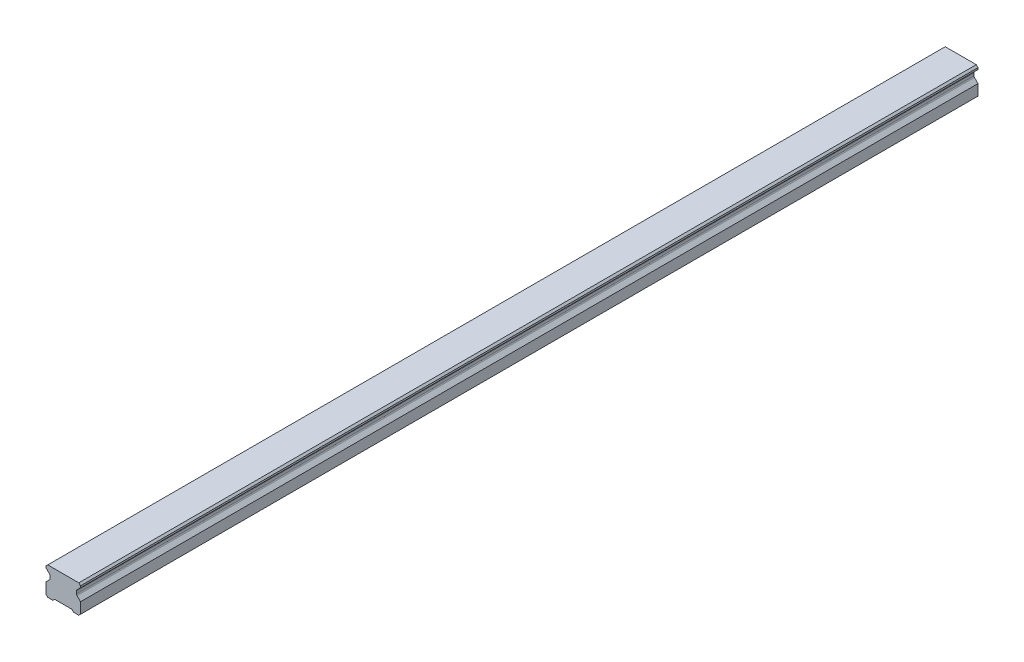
ISO-10303-21;
HEADER;
FILE_DESCRIPTION(('STEP AP214'),'2;1');
FILE_NAME('part.step','',(''),(''),'','','');
FILE_SCHEMA(('AUTOMOTIVE_DESIGN { 1 0 10303 214 1 1 1 1 }'));
ENDSEC;
DATA;
#1=APPLICATION_CONTEXT('core data for automotive mechanical design processes');
#2=APPLICATION_PROTOCOL_DEFINITION('international standard','automotive_design',2000,#1);
#3=PRODUCT_CONTEXT('',#1,'mechanical');
#4=PRODUCT('Part','Part','',(#3));
#5=PRODUCT_RELATED_PRODUCT_CATEGORY('part','',(#4));
#6=PRODUCT_DEFINITION_FORMATION('','',#4);
#7=PRODUCT_DEFINITION_CONTEXT('part definition',#1,'design');
#8=PRODUCT_DEFINITION('design','',#6,#7);
#9=PRODUCT_DEFINITION_SHAPE('','',#8);
#10=(LENGTH_UNIT() NAMED_UNIT(*) SI_UNIT(.MILLI.,.METRE.));
#11=(NAMED_UNIT(*) PLANE_ANGLE_UNIT() SI_UNIT($,.RADIAN.));
#12=(NAMED_UNIT(*) SI_UNIT($,.STERADIAN.) SOLID_ANGLE_UNIT());
#13=UNCERTAINTY_MEASURE_WITH_UNIT(LENGTH_MEASURE(1.E-05),#10,'distance_accuracy_value','');
#14=(GEOMETRIC_REPRESENTATION_CONTEXT(3) GLOBAL_UNCERTAINTY_ASSIGNED_CONTEXT((#13)) GLOBAL_UNIT_ASSIGNED_CONTEXT((#10,
#11,#12)) REPRESENTATION_CONTEXT('',''));
#15=CARTESIAN_POINT('',(0.,0.,0.));
#16=DIRECTION('',(0.,0.,1.));
#17=DIRECTION('',(1.,0.,0.));
#18=AXIS2_PLACEMENT_3D('',#15,#16,#17);
#19=CARTESIAN_POINT('',(0.,11.,-240.));
#20=DIRECTION('',(0.,-1.,0.));
#21=DIRECTION('',(0.,0.,-1.));
#22=AXIS2_PLACEMENT_3D('',#19,#20,#21);
#23=PLANE('',#22);
#24=CARTESIAN_POINT('',(0.,11.,-240.));
#25=DIRECTION('',(0.,-1.,0.));
#26=DIRECTION('',(0.,0.,-1.));
#27=AXIS2_PLACEMENT_3D('',#24,#25,#26);
#28=CIRCLE('',#27,2.5);
#29=CARTESIAN_POINT('',(0.,11.,-242.5));
#30=VERTEX_POINT('',#29);
#31=EDGE_CURVE('E42',#30,#30,#28,.T.);
#32=ORIENTED_EDGE('',*,*,#31,.F.);
#33=EDGE_LOOP('',(#32));
#34=FACE_BOUND('',#33,.T.);
#35=CARTESIAN_POINT('',(0.,11.,-240.));
#36=DIRECTION('',(0.,-1.,0.));
#37=DIRECTION('',(0.,0.,-1.));
#38=AXIS2_PLACEMENT_3D('',#35,#36,#37);
#39=CIRCLE('',#38,3.);
#40=CARTESIAN_POINT('',(0.,11.,-243.));
#41=VERTEX_POINT('',#40);
#42=EDGE_CURVE('E11',#41,#41,#39,.T.);
#43=ORIENTED_EDGE('',*,*,#42,.T.);
#44=EDGE_LOOP('',(#43));
#45=FACE_BOUND('',#44,.T.);
#46=ADVANCED_FACE('F39',(#34,#45),#23,.T.);
#47=CARTESIAN_POINT('',(0.,11.,-240.));
#48=DIRECTION('',(0.,-1.,0.));
#49=DIRECTION('',(0.,0.,-1.));
#50=AXIS2_PLACEMENT_3D('',#47,#48,#49);
#51=CYLINDRICAL_SURFACE('',#50,3.);
#52=ORIENTED_EDGE('',*,*,#42,.F.);
#53=EDGE_LOOP('',(#52));
#54=FACE_BOUND('',#53,.T.);
#55=CARTESIAN_POINT('',(0.,1.,-240.));
#56=DIRECTION('',(0.,-1.,0.));
#57=DIRECTION('',(0.,0.,-1.));
#58=AXIS2_PLACEMENT_3D('',#55,#56,#57);
#59=CIRCLE('',#58,3.);
#60=CARTESIAN_POINT('',(0.,1.,-243.));
#61=VERTEX_POINT('',#60);
#62=EDGE_CURVE('E48',#61,#61,#59,.T.);
#63=ORIENTED_EDGE('',*,*,#62,.T.);
#64=EDGE_LOOP('',(#63));
#65=FACE_BOUND('',#64,.T.);
#66=ADVANCED_FACE('F614',(#54,#65),#51,.F.);
#67=CARTESIAN_POINT('',(0.,11.,-180.));
#68=DIRECTION('',(0.,-1.,0.));
#69=DIRECTION('',(0.,0.,-1.));
#70=AXIS2_PLACEMENT_3D('',#67,#68,#69);
#71=PLANE('',#70);
#72=CARTESIAN_POINT('',(0.,11.,-180.));
#73=DIRECTION('',(0.,-1.,0.));
#74=DIRECTION('',(0.,0.,-1.));
#75=AXIS2_PLACEMENT_3D('',#72,#73,#74);
#76=CIRCLE('',#75,2.5);
#77=CARTESIAN_POINT('',(0.,11.,-182.5));
#78=VERTEX_POINT('',#77);
#79=EDGE_CURVE('E600',#78,#78,#76,.T.);
#80=ORIENTED_EDGE('',*,*,#79,.F.);
#81=EDGE_LOOP('',(#80));
#82=FACE_BOUND('',#81,.T.);
#83=CARTESIAN_POINT('',(0.,11.,-180.));
#84=DIRECTION('',(0.,-1.,0.));
#85=DIRECTION('',(0.,0.,-1.));
#86=AXIS2_PLACEMENT_3D('',#83,#84,#85);
#87=CIRCLE('',#86,3.);
#88=CARTESIAN_POINT('',(0.,11.,-183.));
#89=VERTEX_POINT('',#88);
#90=EDGE_CURVE('E575',#89,#89,#87,.T.);
#91=ORIENTED_EDGE('',*,*,#90,.T.);
#92=EDGE_LOOP('',(#91));
#93=FACE_BOUND('',#92,.T.);
#94=ADVANCED_FACE('F619',(#82,#93),#71,.T.);
#95=CARTESIAN_POINT('',(0.,11.,-180.));
#96=DIRECTION('',(0.,-1.,0.));
#97=DIRECTION('',(0.,0.,-1.));
#98=AXIS2_PLACEMENT_3D('',#95,#96,#97);
#99=CYLINDRICAL_SURFACE('',#98,3.);
#100=ORIENTED_EDGE('',*,*,#90,.F.);
#101=EDGE_LOOP('',(#100));
#102=FACE_BOUND('',#101,.T.);
#103=CARTESIAN_POINT('',(0.,1.,-180.));
#104=DIRECTION('',(0.,-1.,0.));
#105=DIRECTION('',(0.,0.,-1.));
#106=AXIS2_PLACEMENT_3D('',#103,#104,#105);
#107=CIRCLE('',#106,3.);
#108=CARTESIAN_POINT('',(0.,1.,-183.));
#109=VERTEX_POINT('',#108);
#110=EDGE_CURVE('E571',#109,#109,#107,.T.);
#111=ORIENTED_EDGE('',*,*,#110,.T.);
#112=EDGE_LOOP('',(#111));
#113=FACE_BOUND('',#112,.T.);
#114=ADVANCED_FACE('F762',(#102,#113),#99,.F.);
#115=CARTESIAN_POINT('',(0.,11.,-120.));
#116=DIRECTION('',(0.,-1.,0.));
#117=DIRECTION('',(0.,0.,-1.));
#118=AXIS2_PLACEMENT_3D('',#115,#116,#117);
#119=PLANE('',#118);
#120=CARTESIAN_POINT('',(0.,11.,-120.));
#121=DIRECTION('',(0.,-1.,0.));
#122=DIRECTION('',(0.,0.,-1.));
#123=AXIS2_PLACEMENT_3D('',#120,#121,#122);
#124=CIRCLE('',#123,2.5);
#125=CARTESIAN_POINT('',(0.,11.,-122.5));
#126=VERTEX_POINT('',#125);
#127=EDGE_CURVE('E597',#126,#126,#124,.T.);
#128=ORIENTED_EDGE('',*,*,#127,.F.);
#129=EDGE_LOOP('',(#128));
#130=FACE_BOUND('',#129,.T.);
#131=CARTESIAN_POINT('',(0.,11.,-120.));
#132=DIRECTION('',(0.,-1.,0.));
#133=DIRECTION('',(0.,0.,-1.));
#134=AXIS2_PLACEMENT_3D('',#131,#132,#133);
#135=CIRCLE('',#134,3.);
#136=CARTESIAN_POINT('',(0.,11.,-123.));
#137=VERTEX_POINT('',#136);
#138=EDGE_CURVE('E567',#137,#137,#135,.T.);
#139=ORIENTED_EDGE('',*,*,#138,.T.);
#140=EDGE_LOOP('',(#139));
#141=FACE_BOUND('',#140,.T.);
#142=ADVANCED_FACE('F758',(#130,#141),#119,.T.);
#143=CARTESIAN_POINT('',(0.,11.,-120.));
#144=DIRECTION('',(0.,-1.,0.));
#145=DIRECTION('',(0.,0.,-1.));
#146=AXIS2_PLACEMENT_3D('',#143,#144,#145);
#147=CYLINDRICAL_SURFACE('',#146,3.);
#148=ORIENTED_EDGE('',*,*,#138,.F.);
#149=EDGE_LOOP('',(#148));
#150=FACE_BOUND('',#149,.T.);
#151=CARTESIAN_POINT('',(0.,1.,-120.));
#152=DIRECTION('',(0.,-1.,0.));
#153=DIRECTION('',(0.,0.,-1.));
#154=AXIS2_PLACEMENT_3D('',#151,#152,#153);
#155=CIRCLE('',#154,3.);
#156=CARTESIAN_POINT('',(0.,1.,-123.));
#157=VERTEX_POINT('',#156);
#158=EDGE_CURVE('E563',#157,#157,#155,.T.);
#159=ORIENTED_EDGE('',*,*,#158,.T.);
#160=EDGE_LOOP('',(#159));
#161=FACE_BOUND('',#160,.T.);
#162=ADVANCED_FACE('F754',(#150,#161),#147,.F.);
#163=CARTESIAN_POINT('',(0.,11.,-60.));
#164=DIRECTION('',(0.,-1.,0.));
#165=DIRECTION('',(0.,0.,-1.));
#166=AXIS2_PLACEMENT_3D('',#163,#164,#165);
#167=PLANE('',#166);
#168=CARTESIAN_POINT('',(0.,11.,-60.));
#169=DIRECTION('',(0.,-1.,0.));
#170=DIRECTION('',(0.,0.,-1.));
#171=AXIS2_PLACEMENT_3D('',#168,#169,#170);
#172=CIRCLE('',#171,2.5);
#173=CARTESIAN_POINT('',(0.,11.,-62.5));
#174=VERTEX_POINT('',#173);
#175=EDGE_CURVE('E593',#174,#174,#172,.T.);
#176=ORIENTED_EDGE('',*,*,#175,.F.);
#177=EDGE_LOOP('',(#176));
#178=FACE_BOUND('',#177,.T.);
#179=CARTESIAN_POINT('',(0.,11.,-60.));
#180=DIRECTION('',(0.,-1.,0.));
#181=DIRECTION('',(0.,0.,-1.));
#182=AXIS2_PLACEMENT_3D('',#179,#180,#181);
#183=CIRCLE('',#182,3.);
#184=CARTESIAN_POINT('',(0.,11.,-63.));
#185=VERTEX_POINT('',#184);
#186=EDGE_CURVE('E559',#185,#185,#183,.T.);
#187=ORIENTED_EDGE('',*,*,#186,.T.);
#188=EDGE_LOOP('',(#187));
#189=FACE_BOUND('',#188,.T.);
#190=ADVANCED_FACE('F750',(#178,#189),#167,.T.);
#191=CARTESIAN_POINT('',(0.,11.,-60.));
#192=DIRECTION('',(0.,-1.,0.));
#193=DIRECTION('',(0.,0.,-1.));
#194=AXIS2_PLACEMENT_3D('',#191,#192,#193);
#195=CYLINDRICAL_SURFACE('',#194,3.);
#196=ORIENTED_EDGE('',*,*,#186,.F.);
#197=EDGE_LOOP('',(#196));
#198=FACE_BOUND('',#197,.T.);
#199=CARTESIAN_POINT('',(0.,1.,-60.));
#200=DIRECTION('',(0.,-1.,0.));
#201=DIRECTION('',(0.,0.,-1.));
#202=AXIS2_PLACEMENT_3D('',#199,#200,#201);
#203=CIRCLE('',#202,3.);
#204=CARTESIAN_POINT('',(0.,1.,-63.));
#205=VERTEX_POINT('',#204);
#206=EDGE_CURVE('E555',#205,#205,#203,.T.);
#207=ORIENTED_EDGE('',*,*,#206,.T.);
#208=EDGE_LOOP('',(#207));
#209=FACE_BOUND('',#208,.T.);
#210=ADVANCED_FACE('F746',(#198,#209),#195,.F.);
#211=CARTESIAN_POINT('',(0.,11.,0.));
#212=DIRECTION('',(0.,-1.,0.));
#213=DIRECTION('',(0.,0.,-1.));
#214=AXIS2_PLACEMENT_3D('',#211,#212,#213);
#215=PLANE('',#214);
#216=CARTESIAN_POINT('',(0.,11.,0.));
#217=DIRECTION('',(0.,-1.,0.));
#218=DIRECTION('',(0.,0.,-1.));
#219=AXIS2_PLACEMENT_3D('',#216,#217,#218);
#220=CIRCLE('',#219,2.5);
#221=CARTESIAN_POINT('',(0.,11.,-2.49999999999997));
#222=VERTEX_POINT('',#221);
#223=EDGE_CURVE('E589',#222,#222,#220,.T.);
#224=ORIENTED_EDGE('',*,*,#223,.F.);
#225=EDGE_LOOP('',(#224));
#226=FACE_BOUND('',#225,.T.);
#227=CARTESIAN_POINT('',(0.,11.,0.));
#228=DIRECTION('',(0.,-1.,0.));
#229=DIRECTION('',(0.,0.,-1.));
#230=AXIS2_PLACEMENT_3D('',#227,#228,#229);
#231=CIRCLE('',#230,3.);
#232=CARTESIAN_POINT('',(0.,11.,-2.99999999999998));
#233=VERTEX_POINT('',#232);
#234=EDGE_CURVE('E551',#233,#233,#231,.T.);
#235=ORIENTED_EDGE('',*,*,#234,.T.);
#236=EDGE_LOOP('',(#235));
#237=FACE_BOUND('',#236,.T.);
#238=ADVANCED_FACE('F742',(#226,#237),#215,.T.);
#239=CARTESIAN_POINT('',(0.,11.,0.));
#240=DIRECTION('',(0.,-1.,0.));
#241=DIRECTION('',(0.,0.,-1.));
#242=AXIS2_PLACEMENT_3D('',#239,#240,#241);
#243=CYLINDRICAL_SURFACE('',#242,3.);
#244=ORIENTED_EDGE('',*,*,#234,.F.);
#245=EDGE_LOOP('',(#244));
#246=FACE_BOUND('',#245,.T.);
#247=CARTESIAN_POINT('',(0.,1.,0.));
#248=DIRECTION('',(0.,-1.,0.));
#249=DIRECTION('',(0.,0.,-1.));
#250=AXIS2_PLACEMENT_3D('',#247,#248,#249);
#251=CIRCLE('',#250,3.);
#252=CARTESIAN_POINT('',(0.,1.,-2.99999999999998));
#253=VERTEX_POINT('',#252);
#254=EDGE_CURVE('E547',#253,#253,#251,.T.);
#255=ORIENTED_EDGE('',*,*,#254,.T.);
#256=EDGE_LOOP('',(#255));
#257=FACE_BOUND('',#256,.T.);
#258=ADVANCED_FACE('F738',(#246,#257),#243,.F.);
#259=CARTESIAN_POINT('',(0.,11.,60.));
#260=DIRECTION('',(0.,-1.,0.));
#261=DIRECTION('',(0.,0.,-1.));
#262=AXIS2_PLACEMENT_3D('',#259,#260,#261);
#263=PLANE('',#262);
#264=CARTESIAN_POINT('',(0.,11.,60.));
#265=DIRECTION('',(0.,-1.,0.));
#266=DIRECTION('',(0.,0.,-1.));
#267=AXIS2_PLACEMENT_3D('',#264,#265,#266);
#268=CIRCLE('',#267,2.5);
#269=CARTESIAN_POINT('',(0.,11.,57.5));
#270=VERTEX_POINT('',#269);
#271=EDGE_CURVE('E585',#270,#270,#268,.T.);
#272=ORIENTED_EDGE('',*,*,#271,.F.);
#273=EDGE_LOOP('',(#272));
#274=FACE_BOUND('',#273,.T.);
#275=CARTESIAN_POINT('',(0.,11.,60.));
#276=DIRECTION('',(0.,-1.,0.));
#277=DIRECTION('',(0.,0.,-1.));
#278=AXIS2_PLACEMENT_3D('',#275,#276,#277);
#279=CIRCLE('',#278,3.);
#280=CARTESIAN_POINT('',(0.,11.,57.));
#281=VERTEX_POINT('',#280);
#282=EDGE_CURVE('E543',#281,#281,#279,.T.);
#283=ORIENTED_EDGE('',*,*,#282,.T.);
#284=EDGE_LOOP('',(#283));
#285=FACE_BOUND('',#284,.T.);
#286=ADVANCED_FACE('F734',(#274,#285),#263,.T.);
#287=CARTESIAN_POINT('',(0.,11.,60.));
#288=DIRECTION('',(0.,-1.,0.));
#289=DIRECTION('',(0.,0.,-1.));
#290=AXIS2_PLACEMENT_3D('',#287,#288,#289);
#291=CYLINDRICAL_SURFACE('',#290,3.);
#292=ORIENTED_EDGE('',*,*,#282,.F.);
#293=EDGE_LOOP('',(#292));
#294=FACE_BOUND('',#293,.T.);
#295=CARTESIAN_POINT('',(0.,1.,60.));
#296=DIRECTION('',(0.,-1.,0.));
#297=DIRECTION('',(0.,0.,-1.));
#298=AXIS2_PLACEMENT_3D('',#295,#296,#297);
#299=CIRCLE('',#298,3.);
#300=CARTESIAN_POINT('',(0.,1.,57.));
#301=VERTEX_POINT('',#300);
#302=EDGE_CURVE('E539',#301,#301,#299,.T.);
#303=ORIENTED_EDGE('',*,*,#302,.T.);
#304=EDGE_LOOP('',(#303));
#305=FACE_BOUND('',#304,.T.);
#306=ADVANCED_FACE('F730',(#294,#305),#291,.F.);
#307=CARTESIAN_POINT('',(0.,11.,120.));
#308=DIRECTION('',(0.,-1.,0.));
#309=DIRECTION('',(0.,0.,-1.));
#310=AXIS2_PLACEMENT_3D('',#307,#308,#309);
#311=PLANE('',#310);
#312=CARTESIAN_POINT('',(0.,11.,120.));
#313=DIRECTION('',(0.,-1.,0.));
#314=DIRECTION('',(0.,0.,-1.));
#315=AXIS2_PLACEMENT_3D('',#312,#313,#314);
#316=CIRCLE('',#315,2.5);
#317=CARTESIAN_POINT('',(0.,11.,117.5));
#318=VERTEX_POINT('',#317);
#319=EDGE_CURVE('E245',#318,#318,#316,.T.);
#320=ORIENTED_EDGE('',*,*,#319,.F.);
#321=EDGE_LOOP('',(#320));
#322=FACE_BOUND('',#321,.T.);
#323=CARTESIAN_POINT('',(0.,11.,120.));
#324=DIRECTION('',(0.,-1.,0.));
#325=DIRECTION('',(0.,0.,-1.));
#326=AXIS2_PLACEMENT_3D('',#323,#324,#325);
#327=CIRCLE('',#326,3.);
#328=CARTESIAN_POINT('',(0.,11.,117.));
#329=VERTEX_POINT('',#328);
#330=EDGE_CURVE('E535',#329,#329,#327,.T.);
#331=ORIENTED_EDGE('',*,*,#330,.T.);
#332=EDGE_LOOP('',(#331));
#333=FACE_BOUND('',#332,.T.);
#334=ADVANCED_FACE('F726',(#322,#333),#311,.T.);
#335=CARTESIAN_POINT('',(0.,11.,120.));
#336=DIRECTION('',(0.,-1.,0.));
#337=DIRECTION('',(0.,0.,-1.));
#338=AXIS2_PLACEMENT_3D('',#335,#336,#337);
#339=CYLINDRICAL_SURFACE('',#338,3.);
#340=ORIENTED_EDGE('',*,*,#330,.F.);
#341=EDGE_LOOP('',(#340));
#342=FACE_BOUND('',#341,.T.);
#343=CARTESIAN_POINT('',(0.,1.,120.));
#344=DIRECTION('',(0.,-1.,0.));
#345=DIRECTION('',(0.,0.,-1.));
#346=AXIS2_PLACEMENT_3D('',#343,#344,#345);
#347=CIRCLE('',#346,3.);
#348=CARTESIAN_POINT('',(0.,1.,117.));
#349=VERTEX_POINT('',#348);
#350=EDGE_CURVE('E531',#349,#349,#347,.T.);
#351=ORIENTED_EDGE('',*,*,#350,.T.);
#352=EDGE_LOOP('',(#351));
#353=FACE_BOUND('',#352,.T.);
#354=ADVANCED_FACE('F723',(#342,#353),#339,.F.);
#355=CARTESIAN_POINT('',(10.,0.,260.));
#356=DIRECTION('',(0.,1.,0.));
#357=DIRECTION('',(-1.,0.,0.));
#358=AXIS2_PLACEMENT_3D('',#355,#356,#357);
#359=PLANE('',#358);
#360=DIRECTION('',(1.,0.,0.));
#361=VECTOR('',#360,1.);
#362=CARTESIAN_POINT('',(10.,0.,-260.));
#363=LINE('',#362,#361);
#364=CARTESIAN_POINT('',(-9.,0.,-260.));
#365=VERTEX_POINT('',#364);
#366=CARTESIAN_POINT('',(-6.,0.,-260.));
#367=VERTEX_POINT('',#366);
#368=EDGE_CURVE('E415',#365,#367,#363,.T.);
#369=ORIENTED_EDGE('',*,*,#368,.T.);
#370=DIRECTION('',(0.,0.,1.));
#371=VECTOR('',#370,1.);
#372=CARTESIAN_POINT('',(-6.,0.,-260.));
#373=LINE('',#372,#371);
#374=CARTESIAN_POINT('',(-6.,0.,260.));
#375=VERTEX_POINT('',#374);
#376=EDGE_CURVE('E321',#367,#375,#373,.T.);
#377=ORIENTED_EDGE('',*,*,#376,.T.);
#378=DIRECTION('',(1.,0.,0.));
#379=VECTOR('',#378,1.);
#380=CARTESIAN_POINT('',(10.,0.,260.));
#381=LINE('',#380,#379);
#382=CARTESIAN_POINT('',(-9.,0.,260.));
#383=VERTEX_POINT('',#382);
#384=EDGE_CURVE('E396',#383,#375,#381,.T.);
#385=ORIENTED_EDGE('',*,*,#384,.F.);
#386=DIRECTION('',(0.,0.,-1.));
#387=VECTOR('',#386,1.);
#388=CARTESIAN_POINT('',(-9.,0.,260.));
#389=LINE('',#388,#387);
#390=EDGE_CURVE('E466',#383,#365,#389,.T.);
#391=ORIENTED_EDGE('',*,*,#390,.T.);
#392=EDGE_LOOP('',(#369,#377,#385,#391));
#393=FACE_BOUND('',#392,.T.);
#394=ADVANCED_FACE('F688',(#393),#359,.F.);
#395=CARTESIAN_POINT('',(-10.,16.3,260.));
#396=DIRECTION('',(1.,0.,0.));
#397=DIRECTION('',(0.,1.,0.));
#398=AXIS2_PLACEMENT_3D('',#395,#396,#397);
#399=PLANE('',#398);
#400=DIRECTION('',(0.,-1.,0.));
#401=VECTOR('',#400,1.);
#402=CARTESIAN_POINT('',(-10.,16.3,260.));
#403=LINE('',#402,#401);
#404=CARTESIAN_POINT('',(-10.,15.3,260.));
#405=VERTEX_POINT('',#404);
#406=CARTESIAN_POINT('',(-10.,14.3,260.));
#407=VERTEX_POINT('',#406);
#408=EDGE_CURVE('E390',#405,#407,#403,.T.);
#409=ORIENTED_EDGE('',*,*,#408,.F.);
#410=DIRECTION('',(0.,0.,-1.));
#411=VECTOR('',#410,1.);
#412=CARTESIAN_POINT('',(-10.,15.3,260.));
#413=LINE('',#412,#411);
#414=CARTESIAN_POINT('',(-10.,15.3,-260.));
#415=VERTEX_POINT('',#414);
#416=EDGE_CURVE('E409',#405,#415,#413,.T.);
#417=ORIENTED_EDGE('',*,*,#416,.T.);
#418=DIRECTION('',(0.,-1.,0.));
#419=VECTOR('',#418,1.);
#420=CARTESIAN_POINT('',(-10.,16.3,-260.));
#421=LINE('',#420,#419);
#422=CARTESIAN_POINT('',(-10.,14.3,-260.));
#423=VERTEX_POINT('',#422);
#424=EDGE_CURVE('E410',#415,#423,#421,.T.);
#425=ORIENTED_EDGE('',*,*,#424,.T.);
#426=DIRECTION('',(0.,0.,1.));
#427=VECTOR('',#426,1.);
#428=CARTESIAN_POINT('',(-10.,14.3,-260.));
#429=LINE('',#428,#427);
#430=EDGE_CURVE('E345',#423,#407,#429,.T.);
#431=ORIENTED_EDGE('',*,*,#430,.T.);
#432=EDGE_LOOP('',(#409,#417,#425,#431));
#433=FACE_BOUND('',#432,.T.);
#434=ADVANCED_FACE('F692',(#433),#399,.F.);
#435=CARTESIAN_POINT('',(10.,16.3,260.));
#436=DIRECTION('',(-1.,0.,0.));
#437=DIRECTION('',(0.,-1.,0.));
#438=AXIS2_PLACEMENT_3D('',#435,#436,#437);
#439=PLANE('',#438);
#440=DIRECTION('',(0.,1.,0.));
#441=VECTOR('',#440,1.);
#442=CARTESIAN_POINT('',(10.,16.3,260.));
#443=LINE('',#442,#441);
#444=CARTESIAN_POINT('',(10.,1.,260.));
#445=VERTEX_POINT('',#444);
#446=CARTESIAN_POINT('',(10.,7.3,260.));
#447=VERTEX_POINT('',#446);
#448=EDGE_CURVE('E401',#445,#447,#443,.T.);
#449=ORIENTED_EDGE('',*,*,#448,.F.);
#450=DIRECTION('',(0.,0.,-1.));
#451=VECTOR('',#450,1.);
#452=CARTESIAN_POINT('',(10.,1.,260.));
#453=LINE('',#452,#451);
#454=CARTESIAN_POINT('',(10.,1.,-260.));
#455=VERTEX_POINT('',#454);
#456=EDGE_CURVE('E473',#445,#455,#453,.T.);
#457=ORIENTED_EDGE('',*,*,#456,.T.);
#458=DIRECTION('',(0.,1.,0.));
#459=VECTOR('',#458,1.);
#460=CARTESIAN_POINT('',(10.,16.3,-260.));
#461=LINE('',#460,#459);
#462=CARTESIAN_POINT('',(10.,7.3,-260.));
#463=VERTEX_POINT('',#462);
#464=EDGE_CURVE('E420',#455,#463,#461,.T.);
#465=ORIENTED_EDGE('',*,*,#464,.T.);
#466=DIRECTION('',(0.,0.,1.));
#467=VECTOR('',#466,1.);
#468=CARTESIAN_POINT('',(10.,7.3,-260.));
#469=LINE('',#468,#467);
#470=EDGE_CURVE('E375',#463,#447,#469,.T.);
#471=ORIENTED_EDGE('',*,*,#470,.T.);
#472=EDGE_LOOP('',(#449,#457,#465,#471));
#473=FACE_BOUND('',#472,.T.);
#474=ADVANCED_FACE('F683',(#473),#439,.F.);
#475=CARTESIAN_POINT('',(-10.,7.3,-260.));
#476=VERTEX_POINT('',#475);
#477=CARTESIAN_POINT('',(-10.,0.999999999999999,-260.));
#478=VERTEX_POINT('',#477);
#479=EDGE_CURVE('E360',#476,#478,#421,.T.);
#480=ORIENTED_EDGE('',*,*,#479,.T.);
#481=DIRECTION('',(0.,0.,1.));
#482=VECTOR('',#481,1.);
#483=CARTESIAN_POINT('',(-10.,0.999999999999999,260.));
#484=LINE('',#483,#482);
#485=CARTESIAN_POINT('',(-10.,0.999999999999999,260.));
#486=VERTEX_POINT('',#485);
#487=EDGE_CURVE('E470',#478,#486,#484,.T.);
#488=ORIENTED_EDGE('',*,*,#487,.T.);
#489=CARTESIAN_POINT('',(-10.,7.3,260.));
#490=VERTEX_POINT('',#489);
#491=EDGE_CURVE('E395',#490,#486,#403,.T.);
#492=ORIENTED_EDGE('',*,*,#491,.F.);
#493=DIRECTION('',(0.,0.,1.));
#494=VECTOR('',#493,1.);
#495=CARTESIAN_POINT('',(-10.,7.3,-260.));
#496=LINE('',#495,#494);
#497=EDGE_CURVE('E357',#476,#490,#496,.T.);
#498=ORIENTED_EDGE('',*,*,#497,.F.);
#499=EDGE_LOOP('',(#480,#488,#492,#498));
#500=FACE_BOUND('',#499,.T.);
#501=ADVANCED_FACE('F686',(#500),#399,.F.);
#502=CARTESIAN_POINT('',(6.,0.,260.));
#503=VERTEX_POINT('',#502);
#504=CARTESIAN_POINT('',(9.,0.,260.));
#505=VERTEX_POINT('',#504);
#506=EDGE_CURVE('E394',#503,#505,#381,.T.);
#507=ORIENTED_EDGE('',*,*,#506,.F.);
#508=DIRECTION('',(0.,0.,1.));
#509=VECTOR('',#508,1.);
#510=CARTESIAN_POINT('',(6.,0.,-260.));
#511=LINE('',#510,#509);
#512=CARTESIAN_POINT('',(6.,0.,-260.));
#513=VERTEX_POINT('',#512);
#514=EDGE_CURVE('E311',#513,#503,#511,.T.);
#515=ORIENTED_EDGE('',*,*,#514,.F.);
#516=CARTESIAN_POINT('',(9.,0.,-260.));
#517=VERTEX_POINT('',#516);
#518=EDGE_CURVE('E414',#513,#517,#363,.T.);
#519=ORIENTED_EDGE('',*,*,#518,.T.);
#520=DIRECTION('',(0.,0.,1.));
#521=VECTOR('',#520,1.);
#522=CARTESIAN_POINT('',(9.,0.,260.));
#523=LINE('',#522,#521);
#524=EDGE_CURVE('E462',#517,#505,#523,.T.);
#525=ORIENTED_EDGE('',*,*,#524,.T.);
#526=EDGE_LOOP('',(#507,#515,#519,#525));
#527=FACE_BOUND('',#526,.T.);
#528=ADVANCED_FACE('F681',(#527),#359,.F.);
#529=CARTESIAN_POINT('',(10.,14.3,-260.));
#530=VERTEX_POINT('',#529);
#531=CARTESIAN_POINT('',(10.,15.3,-260.));
#532=VERTEX_POINT('',#531);
#533=EDGE_CURVE('E419',#530,#532,#461,.T.);
#534=ORIENTED_EDGE('',*,*,#533,.T.);
#535=DIRECTION('',(0.,0.,1.));
#536=VECTOR('',#535,1.);
#537=CARTESIAN_POINT('',(10.,15.3,260.));
#538=LINE('',#537,#536);
#539=CARTESIAN_POINT('',(10.,15.3,260.));
#540=VERTEX_POINT('',#539);
#541=EDGE_CURVE('E477',#532,#540,#538,.T.);
#542=ORIENTED_EDGE('',*,*,#541,.T.);
#543=CARTESIAN_POINT('',(10.,14.3,260.));
#544=VERTEX_POINT('',#543);
#545=EDGE_CURVE('E400',#544,#540,#443,.T.);
#546=ORIENTED_EDGE('',*,*,#545,.F.);
#547=DIRECTION('',(0.,0.,1.));
#548=VECTOR('',#547,1.);
#549=CARTESIAN_POINT('',(10.,14.3,-260.));
#550=LINE('',#549,#548);
#551=EDGE_CURVE('E350',#530,#544,#550,.T.);
#552=ORIENTED_EDGE('',*,*,#551,.F.);
#553=EDGE_LOOP('',(#534,#542,#546,#552));
#554=FACE_BOUND('',#553,.T.);
#555=ADVANCED_FACE('F677',(#554),#439,.F.);
#556=CARTESIAN_POINT('',(10.,16.3,260.));
#557=DIRECTION('',(0.,-1.,0.));
#558=DIRECTION('',(0.,0.,-1.));
#559=AXIS2_PLACEMENT_3D('',#556,#557,#558);
#560=PLANE('',#559);
#561=DIRECTION('',(-1.,0.,0.));
#562=VECTOR('',#561,1.);
#563=CARTESIAN_POINT('',(10.,16.3,-260.));
#564=LINE('',#563,#562);
#565=CARTESIAN_POINT('',(9.00000000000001,16.3,-260.));
#566=VERTEX_POINT('',#565);
#567=CARTESIAN_POINT('',(-9.,16.3,-260.));
#568=VERTEX_POINT('',#567);
#569=EDGE_CURVE('E424',#566,#568,#564,.T.);
#570=ORIENTED_EDGE('',*,*,#569,.T.);
#571=DIRECTION('',(0.,0.,1.));
#572=VECTOR('',#571,1.);
#573=CARTESIAN_POINT('',(-9.,16.3,260.));
#574=LINE('',#573,#572);
#575=CARTESIAN_POINT('',(-9.,16.3,260.));
#576=VERTEX_POINT('',#575);
#577=EDGE_CURVE('E447',#568,#576,#574,.T.);
#578=ORIENTED_EDGE('',*,*,#577,.T.);
#579=DIRECTION('',(-1.,0.,0.));
#580=VECTOR('',#579,1.);
#581=CARTESIAN_POINT('',(10.,16.3,260.));
#582=LINE('',#581,#580);
#583=CARTESIAN_POINT('',(9.00000000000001,16.3,260.));
#584=VERTEX_POINT('',#583);
#585=EDGE_CURVE('E405',#584,#576,#582,.T.);
#586=ORIENTED_EDGE('',*,*,#585,.F.);
#587=DIRECTION('',(0.,0.,-1.));
#588=VECTOR('',#587,1.);
#589=CARTESIAN_POINT('',(9.00000000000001,16.3,260.));
#590=LINE('',#589,#588);
#591=EDGE_CURVE('E443',#584,#566,#590,.T.);
#592=ORIENTED_EDGE('',*,*,#591,.T.);
#593=EDGE_LOOP('',(#570,#578,#586,#592));
#594=FACE_BOUND('',#593,.T.);
#595=ADVANCED_FACE('F671',(#594),#560,.F.);
#596=CARTESIAN_POINT('',(0.,0.,260.));
#597=DIRECTION('',(0.,0.,-1.));
#598=DIRECTION('',(-1.,0.,0.));
#599=AXIS2_PLACEMENT_3D('',#596,#597,#598);
#600=PLANE('',#599);
#601=ORIENTED_EDGE('',*,*,#384,.T.);
#602=DIRECTION('',(-0.707106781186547,-0.707106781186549,0.));
#603=VECTOR('',#602,1.);
#604=CARTESIAN_POINT('',(-6.,0.,260.));
#605=LINE('',#604,#603);
#606=CARTESIAN_POINT('',(-5.,1.,260.));
#607=VERTEX_POINT('',#606);
#608=EDGE_CURVE('E304',#607,#375,#605,.T.);
#609=ORIENTED_EDGE('',*,*,#608,.F.);
#610=DIRECTION('',(-1.,0.,0.));
#611=VECTOR('',#610,1.);
#612=CARTESIAN_POINT('',(-5.,1.,260.));
#613=LINE('',#612,#611);
#614=CARTESIAN_POINT('',(5.,1.,260.));
#615=VERTEX_POINT('',#614);
#616=EDGE_CURVE('E315',#615,#607,#613,.T.);
#617=ORIENTED_EDGE('',*,*,#616,.F.);
#618=DIRECTION('',(-0.707106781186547,0.707106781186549,0.));
#619=VECTOR('',#618,1.);
#620=CARTESIAN_POINT('',(5.,1.,260.));
#621=LINE('',#620,#619);
#622=EDGE_CURVE('E296',#503,#615,#621,.T.);
#623=ORIENTED_EDGE('',*,*,#622,.F.);
#624=ORIENTED_EDGE('',*,*,#506,.T.);
#625=DIRECTION('',(-0.707106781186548,-0.707106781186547,0.));
#626=VECTOR('',#625,1.);
#627=CARTESIAN_POINT('',(10.,1.,260.));
#628=LINE('',#627,#626);
#629=EDGE_CURVE('E453',#505,#445,#628,.F.);
#630=ORIENTED_EDGE('',*,*,#629,.T.);
#631=ORIENTED_EDGE('',*,*,#448,.T.);
#632=DIRECTION('',(0.707106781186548,-0.707106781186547,0.));
#633=VECTOR('',#632,1.);
#634=CARTESIAN_POINT('',(10.,7.3,260.));
#635=LINE('',#634,#633);
#636=CARTESIAN_POINT('',(7.95955988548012,9.34044011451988,260.));
#637=VERTEX_POINT('',#636);
#638=EDGE_CURVE('E325',#637,#447,#635,.T.);
#639=ORIENTED_EDGE('',*,*,#638,.F.);
#640=CARTESIAN_POINT('',(8.66666666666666,10.0475468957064,260.));
#641=DIRECTION('',(0.,0.,-1.));
#642=DIRECTION('',(-1.,0.,0.));
#643=AXIS2_PLACEMENT_3D('',#640,#641,#642);
#644=CIRCLE('',#643,1.);
#645=CARTESIAN_POINT('',(7.66666666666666,10.0475468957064,260.));
#646=VERTEX_POINT('',#645);
#647=EDGE_CURVE('E508',#637,#646,#644,.T.);
#648=ORIENTED_EDGE('',*,*,#647,.T.);
#649=DIRECTION('',(0.,-1.,0.));
#650=VECTOR('',#649,1.);
#651=CARTESIAN_POINT('',(7.66666666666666,9.63333333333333,260.));
#652=LINE('',#651,#650);
#653=CARTESIAN_POINT('',(7.66666666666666,11.5524531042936,260.));
#654=VERTEX_POINT('',#653);
#655=EDGE_CURVE('E368',#654,#646,#652,.T.);
#656=ORIENTED_EDGE('',*,*,#655,.F.);
#657=CARTESIAN_POINT('',(8.66666666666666,11.5524531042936,260.));
#658=DIRECTION('',(0.,0.,-1.));
#659=DIRECTION('',(-1.,0.,0.));
#660=AXIS2_PLACEMENT_3D('',#657,#658,#659);
#661=CIRCLE('',#660,1.);
#662=CARTESIAN_POINT('',(7.95955988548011,12.2595598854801,260.));
#663=VERTEX_POINT('',#662);
#664=EDGE_CURVE('E514',#654,#663,#661,.T.);
#665=ORIENTED_EDGE('',*,*,#664,.T.);
#666=DIRECTION('',(-0.707106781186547,-0.707106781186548,0.));
#667=VECTOR('',#666,1.);
#668=CARTESIAN_POINT('',(7.66666666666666,11.9666666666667,260.));
#669=LINE('',#668,#667);
#670=EDGE_CURVE('E378',#544,#663,#669,.T.);
#671=ORIENTED_EDGE('',*,*,#670,.F.);
#672=ORIENTED_EDGE('',*,*,#545,.T.);
#673=DIRECTION('',(0.707106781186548,-0.707106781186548,0.));
#674=VECTOR('',#673,1.);
#675=CARTESIAN_POINT('',(9.00000000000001,16.3,260.));
#676=LINE('',#675,#674);
#677=EDGE_CURVE('E450',#540,#584,#676,.F.);
#678=ORIENTED_EDGE('',*,*,#677,.T.);
#679=ORIENTED_EDGE('',*,*,#585,.T.);
#680=DIRECTION('',(0.707106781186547,0.707106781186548,0.));
#681=VECTOR('',#680,1.);
#682=CARTESIAN_POINT('',(-10.,15.3,260.));
#683=LINE('',#682,#681);
#684=EDGE_CURVE('E459',#576,#405,#683,.F.);
#685=ORIENTED_EDGE('',*,*,#684,.T.);
#686=ORIENTED_EDGE('',*,*,#408,.T.);
#687=DIRECTION('',(-0.707106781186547,0.707106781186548,0.));
#688=VECTOR('',#687,1.);
#689=CARTESIAN_POINT('',(-7.66666666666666,11.9666666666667,260.));
#690=LINE('',#689,#688);
#691=CARTESIAN_POINT('',(-7.95955988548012,12.2595598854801,260.));
#692=VERTEX_POINT('',#691);
#693=EDGE_CURVE('E346',#692,#407,#690,.T.);
#694=ORIENTED_EDGE('',*,*,#693,.F.);
#695=CARTESIAN_POINT('',(-8.66666666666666,11.5524531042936,260.));
#696=DIRECTION('',(0.,0.,-1.));
#697=DIRECTION('',(-1.,0.,0.));
#698=AXIS2_PLACEMENT_3D('',#695,#696,#697);
#699=CIRCLE('',#698,1.);
#700=CARTESIAN_POINT('',(-7.66666666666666,11.5524531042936,260.));
#701=VERTEX_POINT('',#700);
#702=EDGE_CURVE('E526',#692,#701,#699,.T.);
#703=ORIENTED_EDGE('',*,*,#702,.T.);
#704=DIRECTION('',(0.,1.,0.));
#705=VECTOR('',#704,1.);
#706=CARTESIAN_POINT('',(-7.66666666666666,9.63333333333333,260.));
#707=LINE('',#706,#705);
#708=CARTESIAN_POINT('',(-7.66666666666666,10.0475468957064,260.));
#709=VERTEX_POINT('',#708);
#710=EDGE_CURVE('E338',#709,#701,#707,.T.);
#711=ORIENTED_EDGE('',*,*,#710,.F.);
#712=CARTESIAN_POINT('',(-8.66666666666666,10.0475468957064,260.));
#713=DIRECTION('',(0.,0.,-1.));
#714=DIRECTION('',(-1.,0.,0.));
#715=AXIS2_PLACEMENT_3D('',#712,#713,#714);
#716=CIRCLE('',#715,1.);
#717=CARTESIAN_POINT('',(-7.95955988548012,9.34044011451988,260.));
#718=VERTEX_POINT('',#717);
#719=EDGE_CURVE('E520',#709,#718,#716,.T.);
#720=ORIENTED_EDGE('',*,*,#719,.T.);
#721=DIRECTION('',(0.707106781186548,0.707106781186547,0.));
#722=VECTOR('',#721,1.);
#723=CARTESIAN_POINT('',(-10.,7.3,260.));
#724=LINE('',#723,#722);
#725=EDGE_CURVE('E349',#490,#718,#724,.T.);
#726=ORIENTED_EDGE('',*,*,#725,.F.);
#727=ORIENTED_EDGE('',*,*,#491,.T.);
#728=DIRECTION('',(-0.707106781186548,0.707106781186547,0.));
#729=VECTOR('',#728,1.);
#730=CARTESIAN_POINT('',(-9.,0.,260.));
#731=LINE('',#730,#729);
#732=EDGE_CURVE('E456',#486,#383,#731,.F.);
#733=ORIENTED_EDGE('',*,*,#732,.T.);
#734=EDGE_LOOP('',(#601,#609,#617,#623,#624,#630,#631,#639,#648,#656,#665,#671,#672,#678,#679,
#685,#686,#694,#703,#711,#720,#726,#727,#733));
#735=FACE_BOUND('',#734,.T.);
#736=ADVANCED_FACE('F668',(#735),#600,.F.);
#737=CARTESIAN_POINT('',(0.,0.,-260.));
#738=DIRECTION('',(0.,0.,-1.));
#739=DIRECTION('',(-1.,0.,0.));
#740=AXIS2_PLACEMENT_3D('',#737,#738,#739);
#741=PLANE('',#740);
#742=DIRECTION('',(-0.707106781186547,-0.707106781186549,0.));
#743=VECTOR('',#742,1.);
#744=CARTESIAN_POINT('',(-6.,0.,-260.));
#745=LINE('',#744,#743);
#746=CARTESIAN_POINT('',(-5.,1.,-260.));
#747=VERTEX_POINT('',#746);
#748=EDGE_CURVE('E307',#747,#367,#745,.T.);
#749=ORIENTED_EDGE('',*,*,#748,.T.);
#750=ORIENTED_EDGE('',*,*,#368,.F.);
#751=DIRECTION('',(0.707106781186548,-0.707106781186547,0.));
#752=VECTOR('',#751,1.);
#753=CARTESIAN_POINT('',(-4.49999999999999,-4.5,-260.));
#754=LINE('',#753,#752);
#755=EDGE_CURVE('E437',#365,#478,#754,.F.);
#756=ORIENTED_EDGE('',*,*,#755,.T.);
#757=ORIENTED_EDGE('',*,*,#479,.F.);
#758=DIRECTION('',(0.707106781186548,0.707106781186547,0.));
#759=VECTOR('',#758,1.);
#760=CARTESIAN_POINT('',(-10.,7.3,-260.));
#761=LINE('',#760,#759);
#762=CARTESIAN_POINT('',(-7.95955988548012,9.34044011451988,-260.));
#763=VERTEX_POINT('',#762);
#764=EDGE_CURVE('E337',#476,#763,#761,.T.);
#765=ORIENTED_EDGE('',*,*,#764,.T.);
#766=CARTESIAN_POINT('',(-8.66666666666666,10.0475468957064,-260.));
#767=DIRECTION('',(0.,0.,-1.));
#768=DIRECTION('',(-1.,0.,0.));
#769=AXIS2_PLACEMENT_3D('',#766,#767,#768);
#770=CIRCLE('',#769,1.);
#771=CARTESIAN_POINT('',(-7.66666666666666,10.0475468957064,-260.));
#772=VERTEX_POINT('',#771);
#773=EDGE_CURVE('E523',#763,#772,#770,.F.);
#774=ORIENTED_EDGE('',*,*,#773,.T.);
#775=DIRECTION('',(0.,1.,0.));
#776=VECTOR('',#775,1.);
#777=CARTESIAN_POINT('',(-7.66666666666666,9.63333333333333,-260.));
#778=LINE('',#777,#776);
#779=CARTESIAN_POINT('',(-7.66666666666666,11.5524531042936,-260.));
#780=VERTEX_POINT('',#779);
#781=EDGE_CURVE('E342',#772,#780,#778,.T.);
#782=ORIENTED_EDGE('',*,*,#781,.T.);
#783=CARTESIAN_POINT('',(-8.66666666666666,11.5524531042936,-260.));
#784=DIRECTION('',(0.,0.,-1.));
#785=DIRECTION('',(-1.,0.,0.));
#786=AXIS2_PLACEMENT_3D('',#783,#784,#785);
#787=CIRCLE('',#786,1.);
#788=CARTESIAN_POINT('',(-7.95955988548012,12.2595598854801,-260.));
#789=VERTEX_POINT('',#788);
#790=EDGE_CURVE('E64',#780,#789,#787,.F.);
#791=ORIENTED_EDGE('',*,*,#790,.T.);
#792=DIRECTION('',(-0.707106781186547,0.707106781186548,0.));
#793=VECTOR('',#792,1.);
#794=CARTESIAN_POINT('',(-7.66666666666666,11.9666666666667,-260.));
#795=LINE('',#794,#793);
#796=EDGE_CURVE('E334',#789,#423,#795,.T.);
#797=ORIENTED_EDGE('',*,*,#796,.T.);
#798=ORIENTED_EDGE('',*,*,#424,.F.);
#799=DIRECTION('',(-0.707106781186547,-0.707106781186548,0.));
#800=VECTOR('',#799,1.);
#801=CARTESIAN_POINT('',(-12.65,12.65,-260.));
#802=LINE('',#801,#800);
#803=EDGE_CURVE('E440',#415,#568,#802,.F.);
#804=ORIENTED_EDGE('',*,*,#803,.T.);
#805=ORIENTED_EDGE('',*,*,#569,.F.);
#806=DIRECTION('',(-0.707106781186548,0.707106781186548,0.));
#807=VECTOR('',#806,1.);
#808=CARTESIAN_POINT('',(12.65,12.65,-260.));
#809=LINE('',#808,#807);
#810=EDGE_CURVE('E430',#566,#532,#809,.F.);
#811=ORIENTED_EDGE('',*,*,#810,.T.);
#812=ORIENTED_EDGE('',*,*,#533,.F.);
#813=DIRECTION('',(-0.707106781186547,-0.707106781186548,0.));
#814=VECTOR('',#813,1.);
#815=CARTESIAN_POINT('',(7.66666666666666,11.9666666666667,-260.));
#816=LINE('',#815,#814);
#817=CARTESIAN_POINT('',(7.95955988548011,12.2595598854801,-260.));
#818=VERTEX_POINT('',#817);
#819=EDGE_CURVE('E367',#530,#818,#816,.T.);
#820=ORIENTED_EDGE('',*,*,#819,.T.);
#821=CARTESIAN_POINT('',(8.66666666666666,11.5524531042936,-260.));
#822=DIRECTION('',(0.,0.,-1.));
#823=DIRECTION('',(-1.,0.,0.));
#824=AXIS2_PLACEMENT_3D('',#821,#822,#823);
#825=CIRCLE('',#824,1.);
#826=CARTESIAN_POINT('',(7.66666666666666,11.5524531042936,-260.));
#827=VERTEX_POINT('',#826);
#828=EDGE_CURVE('E517',#818,#827,#825,.F.);
#829=ORIENTED_EDGE('',*,*,#828,.T.);
#830=DIRECTION('',(0.,-1.,0.));
#831=VECTOR('',#830,1.);
#832=CARTESIAN_POINT('',(7.66666666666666,9.63333333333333,-260.));
#833=LINE('',#832,#831);
#834=CARTESIAN_POINT('',(7.66666666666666,10.0475468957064,-260.));
#835=VERTEX_POINT('',#834);
#836=EDGE_CURVE('E371',#827,#835,#833,.T.);
#837=ORIENTED_EDGE('',*,*,#836,.T.);
#838=CARTESIAN_POINT('',(8.66666666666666,10.0475468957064,-260.));
#839=DIRECTION('',(0.,0.,-1.));
#840=DIRECTION('',(-1.,0.,0.));
#841=AXIS2_PLACEMENT_3D('',#838,#839,#840);
#842=CIRCLE('',#841,1.);
#843=CARTESIAN_POINT('',(7.95955988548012,9.34044011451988,-260.));
#844=VERTEX_POINT('',#843);
#845=EDGE_CURVE('E511',#835,#844,#842,.F.);
#846=ORIENTED_EDGE('',*,*,#845,.T.);
#847=DIRECTION('',(0.707106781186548,-0.707106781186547,0.));
#848=VECTOR('',#847,1.);
#849=CARTESIAN_POINT('',(10.,7.3,-260.));
#850=LINE('',#849,#848);
#851=EDGE_CURVE('E364',#844,#463,#850,.T.);
#852=ORIENTED_EDGE('',*,*,#851,.T.);
#853=ORIENTED_EDGE('',*,*,#464,.F.);
#854=DIRECTION('',(0.707106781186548,0.707106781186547,0.));
#855=VECTOR('',#854,1.);
#856=CARTESIAN_POINT('',(4.5,-4.5,-260.));
#857=LINE('',#856,#855);
#858=EDGE_CURVE('E433',#455,#517,#857,.F.);
#859=ORIENTED_EDGE('',*,*,#858,.T.);
#860=ORIENTED_EDGE('',*,*,#518,.F.);
#861=DIRECTION('',(-0.707106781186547,0.707106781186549,0.));
#862=VECTOR('',#861,1.);
#863=CARTESIAN_POINT('',(5.,1.,-260.));
#864=LINE('',#863,#862);
#865=CARTESIAN_POINT('',(5.,1.,-260.));
#866=VERTEX_POINT('',#865);
#867=EDGE_CURVE('E300',#513,#866,#864,.T.);
#868=ORIENTED_EDGE('',*,*,#867,.T.);
#869=DIRECTION('',(-1.,0.,0.));
#870=VECTOR('',#869,1.);
#871=CARTESIAN_POINT('',(-5.,1.,-260.));
#872=LINE('',#871,#870);
#873=EDGE_CURVE('E56',#866,#747,#872,.T.);
#874=ORIENTED_EDGE('',*,*,#873,.T.);
#875=EDGE_LOOP('',(#749,#750,#756,#757,#765,#774,#782,#791,#797,#798,#804,#805,#811,#812,#820,
#829,#837,#846,#852,#853,#859,#860,#868,#874));
#876=FACE_BOUND('',#875,.T.);
#877=ADVANCED_FACE('F666',(#876),#741,.T.);
#878=CARTESIAN_POINT('',(10.,7.3,-260.));
#879=DIRECTION('',(-0.707106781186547,-0.707106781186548,0.));
#880=DIRECTION('',(0.707106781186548,-0.707106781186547,0.));
#881=AXIS2_PLACEMENT_3D('',#878,#879,#880);
#882=PLANE('',#881);
#883=ORIENTED_EDGE('',*,*,#851,.F.);
#884=DIRECTION('',(0.,0.,1.));
#885=VECTOR('',#884,1.);
#886=CARTESIAN_POINT('',(7.95955988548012,9.34044011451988,260.));
#887=LINE('',#886,#885);
#888=EDGE_CURVE('E480',#844,#637,#887,.T.);
#889=ORIENTED_EDGE('',*,*,#888,.T.);
#890=ORIENTED_EDGE('',*,*,#638,.T.);
#891=ORIENTED_EDGE('',*,*,#470,.F.);
#892=EDGE_LOOP('',(#883,#889,#890,#891));
#893=FACE_BOUND('',#892,.T.);
#894=ADVANCED_FACE('F659',(#893),#882,.F.);
#895=CARTESIAN_POINT('',(7.66666666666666,9.63333333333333,-260.));
#896=DIRECTION('',(-1.,0.,0.));
#897=DIRECTION('',(0.,-1.,0.));
#898=AXIS2_PLACEMENT_3D('',#895,#896,#897);
#899=PLANE('',#898);
#900=ORIENTED_EDGE('',*,*,#655,.T.);
#901=DIRECTION('',(0.,0.,1.));
#902=VECTOR('',#901,1.);
#903=CARTESIAN_POINT('',(7.66666666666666,10.0475468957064,-260.));
#904=LINE('',#903,#902);
#905=EDGE_CURVE('E488',#646,#835,#904,.F.);
#906=ORIENTED_EDGE('',*,*,#905,.T.);
#907=ORIENTED_EDGE('',*,*,#836,.F.);
#908=DIRECTION('',(0.,0.,1.));
#909=VECTOR('',#908,1.);
#910=CARTESIAN_POINT('',(7.66666666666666,11.5524531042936,260.));
#911=LINE('',#910,#909);
#912=EDGE_CURVE('E484',#827,#654,#911,.T.);
#913=ORIENTED_EDGE('',*,*,#912,.T.);
#914=EDGE_LOOP('',(#900,#906,#907,#913));
#915=FACE_BOUND('',#914,.T.);
#916=ADVANCED_FACE('F656',(#915),#899,.F.);
#917=CARTESIAN_POINT('',(7.66666666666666,11.9666666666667,-260.));
#918=DIRECTION('',(-0.707106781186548,0.707106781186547,0.));
#919=DIRECTION('',(-0.707106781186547,-0.707106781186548,0.));
#920=AXIS2_PLACEMENT_3D('',#917,#918,#919);
#921=PLANE('',#920);
#922=ORIENTED_EDGE('',*,*,#670,.T.);
#923=DIRECTION('',(0.,0.,1.));
#924=VECTOR('',#923,1.);
#925=CARTESIAN_POINT('',(7.95955988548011,12.2595598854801,-260.));
#926=LINE('',#925,#924);
#927=EDGE_CURVE('E491',#663,#818,#926,.F.);
#928=ORIENTED_EDGE('',*,*,#927,.T.);
#929=ORIENTED_EDGE('',*,*,#819,.F.);
#930=ORIENTED_EDGE('',*,*,#551,.T.);
#931=EDGE_LOOP('',(#922,#928,#929,#930));
#932=FACE_BOUND('',#931,.T.);
#933=ADVANCED_FACE('F654',(#932),#921,.F.);
#934=CARTESIAN_POINT('',(-7.66666666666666,11.9666666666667,-260.));
#935=DIRECTION('',(0.707106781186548,0.707106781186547,0.));
#936=DIRECTION('',(-0.707106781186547,0.707106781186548,0.));
#937=AXIS2_PLACEMENT_3D('',#934,#935,#936);
#938=PLANE('',#937);
#939=ORIENTED_EDGE('',*,*,#796,.F.);
#940=DIRECTION('',(0.,0.,1.));
#941=VECTOR('',#940,1.);
#942=CARTESIAN_POINT('',(-7.95955988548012,12.2595598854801,260.));
#943=LINE('',#942,#941);
#944=EDGE_CURVE('E504',#789,#692,#943,.T.);
#945=ORIENTED_EDGE('',*,*,#944,.T.);
#946=ORIENTED_EDGE('',*,*,#693,.T.);
#947=ORIENTED_EDGE('',*,*,#430,.F.);
#948=EDGE_LOOP('',(#939,#945,#946,#947));
#949=FACE_BOUND('',#948,.T.);
#950=ADVANCED_FACE('F646',(#949),#938,.F.);
#951=CARTESIAN_POINT('',(-7.66666666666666,9.63333333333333,-260.));
#952=DIRECTION('',(1.,0.,0.));
#953=DIRECTION('',(0.,1.,0.));
#954=AXIS2_PLACEMENT_3D('',#951,#952,#953);
#955=PLANE('',#954);
#956=ORIENTED_EDGE('',*,*,#781,.F.);
#957=DIRECTION('',(0.,0.,1.));
#958=VECTOR('',#957,1.);
#959=CARTESIAN_POINT('',(-7.66666666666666,10.0475468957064,260.));
#960=LINE('',#959,#958);
#961=EDGE_CURVE('E497',#772,#709,#960,.T.);
#962=ORIENTED_EDGE('',*,*,#961,.T.);
#963=ORIENTED_EDGE('',*,*,#710,.T.);
#964=DIRECTION('',(0.,0.,1.));
#965=VECTOR('',#964,1.);
#966=CARTESIAN_POINT('',(-7.66666666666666,11.5524531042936,-260.));
#967=LINE('',#966,#965);
#968=EDGE_CURVE('E494',#701,#780,#967,.F.);
#969=ORIENTED_EDGE('',*,*,#968,.T.);
#970=EDGE_LOOP('',(#956,#962,#963,#969));
#971=FACE_BOUND('',#970,.T.);
#972=ADVANCED_FACE('F642',(#971),#955,.F.);
#973=CARTESIAN_POINT('',(-10.,7.3,-260.));
#974=DIRECTION('',(0.707106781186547,-0.707106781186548,0.));
#975=DIRECTION('',(0.707106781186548,0.707106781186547,0.));
#976=AXIS2_PLACEMENT_3D('',#973,#974,#975);
#977=PLANE('',#976);
#978=ORIENTED_EDGE('',*,*,#725,.T.);
#979=DIRECTION('',(0.,0.,1.));
#980=VECTOR('',#979,1.);
#981=CARTESIAN_POINT('',(-7.95955988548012,9.34044011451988,-260.));
#982=LINE('',#981,#980);
#983=EDGE_CURVE('E501',#718,#763,#982,.F.);
#984=ORIENTED_EDGE('',*,*,#983,.T.);
#985=ORIENTED_EDGE('',*,*,#764,.F.);
#986=ORIENTED_EDGE('',*,*,#497,.T.);
#987=EDGE_LOOP('',(#978,#984,#985,#986));
#988=FACE_BOUND('',#987,.T.);
#989=ADVANCED_FACE('F645',(#988),#977,.F.);
#990=CARTESIAN_POINT('',(-10.,15.3,260.));
#991=DIRECTION('',(0.707106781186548,-0.707106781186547,0.));
#992=DIRECTION('',(0.,0.,-1.));
#993=AXIS2_PLACEMENT_3D('',#990,#991,#992);
#994=PLANE('',#993);
#995=ORIENTED_EDGE('',*,*,#684,.F.);
#996=ORIENTED_EDGE('',*,*,#577,.F.);
#997=ORIENTED_EDGE('',*,*,#803,.F.);
#998=ORIENTED_EDGE('',*,*,#416,.F.);
#999=EDGE_LOOP('',(#995,#996,#997,#998));
#1000=FACE_BOUND('',#999,.T.);
#1001=ADVANCED_FACE('F650',(#1000),#994,.F.);
#1002=CARTESIAN_POINT('',(-9.,0.,260.));
#1003=DIRECTION('',(0.707106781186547,0.707106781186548,0.));
#1004=DIRECTION('',(0.,0.,-1.));
#1005=AXIS2_PLACEMENT_3D('',#1002,#1003,#1004);
#1006=PLANE('',#1005);
#1007=ORIENTED_EDGE('',*,*,#732,.F.);
#1008=ORIENTED_EDGE('',*,*,#487,.F.);
#1009=ORIENTED_EDGE('',*,*,#755,.F.);
#1010=ORIENTED_EDGE('',*,*,#390,.F.);
#1011=EDGE_LOOP('',(#1007,#1008,#1009,#1010));
#1012=FACE_BOUND('',#1011,.T.);
#1013=ADVANCED_FACE('F695',(#1012),#1006,.F.);
#1014=CARTESIAN_POINT('',(10.,1.,260.));
#1015=DIRECTION('',(-0.707106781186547,0.707106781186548,0.));
#1016=DIRECTION('',(0.,0.,-1.));
#1017=AXIS2_PLACEMENT_3D('',#1014,#1015,#1016);
#1018=PLANE('',#1017);
#1019=ORIENTED_EDGE('',*,*,#629,.F.);
#1020=ORIENTED_EDGE('',*,*,#524,.F.);
#1021=ORIENTED_EDGE('',*,*,#858,.F.);
#1022=ORIENTED_EDGE('',*,*,#456,.F.);
#1023=EDGE_LOOP('',(#1019,#1020,#1021,#1022));
#1024=FACE_BOUND('',#1023,.T.);
#1025=ADVANCED_FACE('F699',(#1024),#1018,.F.);
#1026=CARTESIAN_POINT('',(9.00000000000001,16.3,260.));
#1027=DIRECTION('',(-0.707106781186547,-0.707106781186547,0.));
#1028=DIRECTION('',(0.,0.,-1.));
#1029=AXIS2_PLACEMENT_3D('',#1026,#1027,#1028);
#1030=PLANE('',#1029);
#1031=ORIENTED_EDGE('',*,*,#677,.F.);
#1032=ORIENTED_EDGE('',*,*,#541,.F.);
#1033=ORIENTED_EDGE('',*,*,#810,.F.);
#1034=ORIENTED_EDGE('',*,*,#591,.F.);
#1035=EDGE_LOOP('',(#1031,#1032,#1033,#1034));
#1036=FACE_BOUND('',#1035,.T.);
#1037=ADVANCED_FACE('F703',(#1036),#1030,.F.);
#1038=CARTESIAN_POINT('',(8.66666666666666,10.0475468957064,-260.));
#1039=DIRECTION('',(0.,0.,-1.));
#1040=DIRECTION('',(-1.,0.,0.));
#1041=AXIS2_PLACEMENT_3D('',#1038,#1039,#1040);
#1042=CYLINDRICAL_SURFACE('',#1041,1.);
#1043=ORIENTED_EDGE('',*,*,#845,.F.);
#1044=ORIENTED_EDGE('',*,*,#905,.F.);
#1045=ORIENTED_EDGE('',*,*,#647,.F.);
#1046=ORIENTED_EDGE('',*,*,#888,.F.);
#1047=EDGE_LOOP('',(#1043,#1044,#1045,#1046));
#1048=FACE_BOUND('',#1047,.T.);
#1049=ADVANCED_FACE('F707',(#1048),#1042,.F.);
#1050=CARTESIAN_POINT('',(8.66666666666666,11.5524531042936,-260.));
#1051=DIRECTION('',(0.,0.,-1.));
#1052=DIRECTION('',(-1.,0.,0.));
#1053=AXIS2_PLACEMENT_3D('',#1050,#1051,#1052);
#1054=CYLINDRICAL_SURFACE('',#1053,1.);
#1055=ORIENTED_EDGE('',*,*,#828,.F.);
#1056=ORIENTED_EDGE('',*,*,#927,.F.);
#1057=ORIENTED_EDGE('',*,*,#664,.F.);
#1058=ORIENTED_EDGE('',*,*,#912,.F.);
#1059=EDGE_LOOP('',(#1055,#1056,#1057,#1058));
#1060=FACE_BOUND('',#1059,.T.);
#1061=ADVANCED_FACE('F711',(#1060),#1054,.F.);
#1062=CARTESIAN_POINT('',(-8.66666666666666,10.0475468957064,-260.));
#1063=DIRECTION('',(0.,0.,-1.));
#1064=DIRECTION('',(-1.,0.,0.));
#1065=AXIS2_PLACEMENT_3D('',#1062,#1063,#1064);
#1066=CYLINDRICAL_SURFACE('',#1065,1.);
#1067=ORIENTED_EDGE('',*,*,#773,.F.);
#1068=ORIENTED_EDGE('',*,*,#983,.F.);
#1069=ORIENTED_EDGE('',*,*,#719,.F.);
#1070=ORIENTED_EDGE('',*,*,#961,.F.);
#1071=EDGE_LOOP('',(#1067,#1068,#1069,#1070));
#1072=FACE_BOUND('',#1071,.T.);
#1073=ADVANCED_FACE('F715',(#1072),#1066,.F.);
#1074=CARTESIAN_POINT('',(-8.66666666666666,11.5524531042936,-260.));
#1075=DIRECTION('',(0.,0.,-1.));
#1076=DIRECTION('',(-1.,0.,0.));
#1077=AXIS2_PLACEMENT_3D('',#1074,#1075,#1076);
#1078=CYLINDRICAL_SURFACE('',#1077,1.);
#1079=ORIENTED_EDGE('',*,*,#790,.F.);
#1080=ORIENTED_EDGE('',*,*,#968,.F.);
#1081=ORIENTED_EDGE('',*,*,#702,.F.);
#1082=ORIENTED_EDGE('',*,*,#944,.F.);
#1083=EDGE_LOOP('',(#1079,#1080,#1081,#1082));
#1084=FACE_BOUND('',#1083,.T.);
#1085=ADVANCED_FACE('F635',(#1084),#1078,.F.);
#1086=CARTESIAN_POINT('',(-6.,0.,-260.));
#1087=DIRECTION('',(-0.707106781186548,0.707106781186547,0.));
#1088=DIRECTION('',(-0.707106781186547,-0.707106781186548,0.));
#1089=AXIS2_PLACEMENT_3D('',#1086,#1087,#1088);
#1090=PLANE('',#1089);
#1091=ORIENTED_EDGE('',*,*,#608,.T.);
#1092=ORIENTED_EDGE('',*,*,#376,.F.);
#1093=ORIENTED_EDGE('',*,*,#748,.F.);
#1094=DIRECTION('',(0.,0.,1.));
#1095=VECTOR('',#1094,1.);
#1096=CARTESIAN_POINT('',(-5.,1.,-260.));
#1097=LINE('',#1096,#1095);
#1098=EDGE_CURVE('E326',#747,#607,#1097,.T.);
#1099=ORIENTED_EDGE('',*,*,#1098,.T.);
#1100=EDGE_LOOP('',(#1091,#1092,#1093,#1099));
#1101=FACE_BOUND('',#1100,.T.);
#1102=ADVANCED_FACE('F625',(#1101),#1090,.F.);
#1103=CARTESIAN_POINT('',(-5.,1.,-260.));
#1104=DIRECTION('',(0.,1.,0.));
#1105=DIRECTION('',(0.,0.,1.));
#1106=AXIS2_PLACEMENT_3D('',#1103,#1104,#1105);
#1107=PLANE('',#1106);
#1108=CARTESIAN_POINT('',(0.,1.,180.));
#1109=DIRECTION('',(0.,-1.,0.));
#1110=DIRECTION('',(0.,0.,-1.));
#1111=AXIS2_PLACEMENT_3D('',#1108,#1109,#1110);
#1112=CIRCLE('',#1111,3.);
#1113=CARTESIAN_POINT('',(0.,1.,177.));
#1114=VERTEX_POINT('',#1113);
#1115=EDGE_CURVE('E275',#1114,#1114,#1112,.T.);
#1116=ORIENTED_EDGE('',*,*,#1115,.F.);
#1117=EDGE_LOOP('',(#1116));
#1118=FACE_BOUND('',#1117,.T.);
#1119=CARTESIAN_POINT('',(0.,1.,240.));
#1120=DIRECTION('',(0.,-1.,0.));
#1121=DIRECTION('',(0.,0.,-1.));
#1122=AXIS2_PLACEMENT_3D('',#1119,#1120,#1121);
#1123=CIRCLE('',#1122,3.);
#1124=CARTESIAN_POINT('',(0.,1.,237.));
#1125=VERTEX_POINT('',#1124);
#1126=EDGE_CURVE('E291',#1125,#1125,#1123,.T.);
#1127=ORIENTED_EDGE('',*,*,#1126,.F.);
#1128=EDGE_LOOP('',(#1127));
#1129=FACE_BOUND('',#1128,.T.);
#1130=ORIENTED_EDGE('',*,*,#616,.T.);
#1131=ORIENTED_EDGE('',*,*,#1098,.F.);
#1132=ORIENTED_EDGE('',*,*,#873,.F.);
#1133=DIRECTION('',(0.,0.,1.));
#1134=VECTOR('',#1133,1.);
#1135=CARTESIAN_POINT('',(5.,1.,-260.));
#1136=LINE('',#1135,#1134);
#1137=EDGE_CURVE('E329',#866,#615,#1136,.T.);
#1138=ORIENTED_EDGE('',*,*,#1137,.T.);
#1139=EDGE_LOOP('',(#1130,#1131,#1132,#1138));
#1140=FACE_BOUND('',#1139,.T.);
#1141=ORIENTED_EDGE('',*,*,#350,.F.);
#1142=EDGE_LOOP('',(#1141));
#1143=FACE_BOUND('',#1142,.T.);
#1144=ORIENTED_EDGE('',*,*,#302,.F.);
#1145=EDGE_LOOP('',(#1144));
#1146=FACE_BOUND('',#1145,.T.);
#1147=ORIENTED_EDGE('',*,*,#254,.F.);
#1148=EDGE_LOOP('',(#1147));
#1149=FACE_BOUND('',#1148,.T.);
#1150=ORIENTED_EDGE('',*,*,#206,.F.);
#1151=EDGE_LOOP('',(#1150));
#1152=FACE_BOUND('',#1151,.T.);
#1153=ORIENTED_EDGE('',*,*,#158,.F.);
#1154=EDGE_LOOP('',(#1153));
#1155=FACE_BOUND('',#1154,.T.);
#1156=ORIENTED_EDGE('',*,*,#110,.F.);
#1157=EDGE_LOOP('',(#1156));
#1158=FACE_BOUND('',#1157,.T.);
#1159=ORIENTED_EDGE('',*,*,#62,.F.);
#1160=EDGE_LOOP('',(#1159));
#1161=FACE_BOUND('',#1160,.T.);
#1162=ADVANCED_FACE('F622',(#1118,#1129,#1140,#1143,#1146,#1149,#1152,#1155,#1158,#1161),#1107,.F.);
#1163=CARTESIAN_POINT('',(5.,1.,-260.));
#1164=DIRECTION('',(0.707106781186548,0.707106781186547,0.));
#1165=DIRECTION('',(-0.707106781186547,0.707106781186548,0.));
#1166=AXIS2_PLACEMENT_3D('',#1163,#1164,#1165);
#1167=PLANE('',#1166);
#1168=ORIENTED_EDGE('',*,*,#622,.T.);
#1169=ORIENTED_EDGE('',*,*,#1137,.F.);
#1170=ORIENTED_EDGE('',*,*,#867,.F.);
#1171=ORIENTED_EDGE('',*,*,#514,.T.);
#1172=EDGE_LOOP('',(#1168,#1169,#1170,#1171));
#1173=FACE_BOUND('',#1172,.T.);
#1174=ADVANCED_FACE('F624',(#1173),#1167,.F.);
#1175=CARTESIAN_POINT('',(0.,11.,240.));
#1176=DIRECTION('',(0.,-1.,0.));
#1177=DIRECTION('',(0.,0.,-1.));
#1178=AXIS2_PLACEMENT_3D('',#1175,#1176,#1177);
#1179=CYLINDRICAL_SURFACE('',#1178,3.);
#1180=CARTESIAN_POINT('',(0.,11.,240.));
#1181=DIRECTION('',(0.,-1.,0.));
#1182=DIRECTION('',(0.,0.,-1.));
#1183=AXIS2_PLACEMENT_3D('',#1180,#1181,#1182);
#1184=CIRCLE('',#1183,3.);
#1185=CARTESIAN_POINT('',(0.,11.,237.));
#1186=VERTEX_POINT('',#1185);
#1187=EDGE_CURVE('E292',#1186,#1186,#1184,.T.);
#1188=ORIENTED_EDGE('',*,*,#1187,.F.);
#1189=EDGE_LOOP('',(#1188));
#1190=FACE_BOUND('',#1189,.T.);
#1191=ORIENTED_EDGE('',*,*,#1126,.T.);
#1192=EDGE_LOOP('',(#1191));
#1193=FACE_BOUND('',#1192,.T.);
#1194=ADVANCED_FACE('F632',(#1190,#1193),#1179,.F.);
#1195=CARTESIAN_POINT('',(0.,11.,240.));
#1196=DIRECTION('',(0.,-1.,0.));
#1197=DIRECTION('',(0.,0.,-1.));
#1198=AXIS2_PLACEMENT_3D('',#1195,#1196,#1197);
#1199=PLANE('',#1198);
#1200=CARTESIAN_POINT('',(0.,11.,240.));
#1201=DIRECTION('',(0.,-1.,0.));
#1202=DIRECTION('',(0.,0.,-1.));
#1203=AXIS2_PLACEMENT_3D('',#1200,#1201,#1202);
#1204=CIRCLE('',#1203,2.5);
#1205=CARTESIAN_POINT('',(0.,11.,237.5));
#1206=VERTEX_POINT('',#1205);
#1207=EDGE_CURVE('E287',#1206,#1206,#1204,.T.);
#1208=ORIENTED_EDGE('',*,*,#1207,.F.);
#1209=EDGE_LOOP('',(#1208));
#1210=FACE_BOUND('',#1209,.T.);
#1211=ORIENTED_EDGE('',*,*,#1187,.T.);
#1212=EDGE_LOOP('',(#1211));
#1213=FACE_BOUND('',#1212,.T.);
#1214=ADVANCED_FACE('F905',(#1210,#1213),#1199,.T.);
#1215=CARTESIAN_POINT('',(0.,14.,240.));
#1216=DIRECTION('',(0.,-1.,0.));
#1217=DIRECTION('',(0.,0.,-1.));
#1218=AXIS2_PLACEMENT_3D('',#1215,#1216,#1217);
#1219=CYLINDRICAL_SURFACE('',#1218,2.5);
#1220=CARTESIAN_POINT('',(0.,14.,240.));
#1221=DIRECTION('',(0.,-1.,0.));
#1222=DIRECTION('',(0.,0.,-1.));
#1223=AXIS2_PLACEMENT_3D('',#1220,#1221,#1222);
#1224=CIRCLE('',#1223,2.5);
#1225=CARTESIAN_POINT('',(0.,14.,237.5));
#1226=VERTEX_POINT('',#1225);
#1227=EDGE_CURVE('E283',#1226,#1226,#1224,.T.);
#1228=CARTESIAN_POINT('',(0.,11.,237.5));
#1229=CARTESIAN_POINT('',(0.,11.03125,237.5));
#1230=CARTESIAN_POINT('',(0.,11.0625,237.5));
#1231=CARTESIAN_POINT('',(0.,11.125,237.5));
#1232=CARTESIAN_POINT('',(0.,11.15625,237.5));
#1233=CARTESIAN_POINT('',(0.,11.21875,237.5));
#1234=CARTESIAN_POINT('',(0.,11.25,237.5));
#1235=CARTESIAN_POINT('',(0.,11.3125,237.5));
#1236=CARTESIAN_POINT('',(0.,11.34375,237.5));
#1237=CARTESIAN_POINT('',(0.,11.40625,237.5));
#1238=CARTESIAN_POINT('',(0.,11.4375,237.5));
#1239=CARTESIAN_POINT('',(0.,11.5,237.5));
#1240=CARTESIAN_POINT('',(0.,11.53125,237.5));
#1241=CARTESIAN_POINT('',(0.,11.59375,237.5));
#1242=CARTESIAN_POINT('',(0.,11.625,237.5));
#1243=CARTESIAN_POINT('',(0.,11.6875,237.5));
#1244=CARTESIAN_POINT('',(0.,11.71875,237.5));
#1245=CARTESIAN_POINT('',(0.,11.78125,237.5));
#1246=CARTESIAN_POINT('',(0.,11.8125,237.5));
#1247=CARTESIAN_POINT('',(0.,11.875,237.5));
#1248=CARTESIAN_POINT('',(0.,11.90625,237.5));
#1249=CARTESIAN_POINT('',(0.,11.96875,237.5));
#1250=CARTESIAN_POINT('',(0.,12.,237.5));
#1251=CARTESIAN_POINT('',(0.,12.0625,237.5));
#1252=CARTESIAN_POINT('',(0.,12.09375,237.5));
#1253=CARTESIAN_POINT('',(0.,12.15625,237.5));
#1254=CARTESIAN_POINT('',(0.,12.1875,237.5));
#1255=CARTESIAN_POINT('',(0.,12.25,237.5));
#1256=CARTESIAN_POINT('',(0.,12.28125,237.5));
#1257=CARTESIAN_POINT('',(0.,12.34375,237.5));
#1258=CARTESIAN_POINT('',(0.,12.375,237.5));
#1259=CARTESIAN_POINT('',(0.,12.4375,237.5));
#1260=CARTESIAN_POINT('',(0.,12.46875,237.5));
#1261=CARTESIAN_POINT('',(0.,12.53125,237.5));
#1262=CARTESIAN_POINT('',(0.,12.5625,237.5));
#1263=CARTESIAN_POINT('',(0.,12.625,237.5));
#1264=CARTESIAN_POINT('',(0.,12.65625,237.5));
#1265=CARTESIAN_POINT('',(0.,12.71875,237.5));
#1266=CARTESIAN_POINT('',(0.,12.75,237.5));
#1267=CARTESIAN_POINT('',(0.,12.8125,237.5));
#1268=CARTESIAN_POINT('',(0.,12.84375,237.5));
#1269=CARTESIAN_POINT('',(0.,12.90625,237.5));
#1270=CARTESIAN_POINT('',(0.,12.9375,237.5));
#1271=CARTESIAN_POINT('',(0.,13.,237.5));
#1272=CARTESIAN_POINT('',(0.,13.03125,237.5));
#1273=CARTESIAN_POINT('',(0.,13.09375,237.5));
#1274=CARTESIAN_POINT('',(0.,13.125,237.5));
#1275=CARTESIAN_POINT('',(0.,13.1875,237.5));
#1276=CARTESIAN_POINT('',(0.,13.21875,237.5));
#1277=CARTESIAN_POINT('',(0.,13.28125,237.5));
#1278=CARTESIAN_POINT('',(0.,13.3125,237.5));
#1279=CARTESIAN_POINT('',(0.,13.375,237.5));
#1280=CARTESIAN_POINT('',(0.,13.40625,237.5));
#1281=CARTESIAN_POINT('',(0.,13.46875,237.5));
#1282=CARTESIAN_POINT('',(0.,13.5,237.5));
#1283=CARTESIAN_POINT('',(0.,13.5625,237.5));
#1284=CARTESIAN_POINT('',(0.,13.59375,237.5));
#1285=CARTESIAN_POINT('',(0.,13.65625,237.5));
#1286=CARTESIAN_POINT('',(0.,13.6875,237.5));
#1287=CARTESIAN_POINT('',(0.,13.75,237.5));
#1288=CARTESIAN_POINT('',(0.,13.78125,237.5));
#1289=CARTESIAN_POINT('',(0.,13.84375,237.5));
#1290=CARTESIAN_POINT('',(0.,13.875,237.5));
#1291=CARTESIAN_POINT('',(0.,13.9375,237.5));
#1292=CARTESIAN_POINT('',(0.,13.96875,237.5));
#1293=CARTESIAN_POINT('',(0.,14.,237.5));
#1294=B_SPLINE_CURVE_WITH_KNOTS('',3,(#1228,#1229,#1230,#1231,#1232,#1233,#1234,#1235,#1236,
#1237,#1238,#1239,#1240,#1241,#1242,#1243,#1244,#1245,#1246,#1247,#1248,#1249,#1250,#1251,#1252,
#1253,#1254,#1255,#1256,#1257,#1258,#1259,#1260,#1261,#1262,#1263,#1264,#1265,#1266,#1267,#1268,
#1269,#1270,#1271,#1272,#1273,#1274,#1275,#1276,#1277,#1278,#1279,#1280,#1281,#1282,#1283,#1284,
#1285,#1286,#1287,#1288,#1289,#1290,#1291,#1292,#1293),.UNSPECIFIED.,.F.,.F.,(4,2,2,2,2,2,2,2,2,
2,2,2,2,2,2,2,2,2,2,2,2,2,2,2,2,2,2,2,2,2,2,2,4),(0.,0.0937500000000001,0.1875,
0.281249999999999,0.374999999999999,0.468749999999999,0.562499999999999,0.656249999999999,
0.749999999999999,0.843749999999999,0.937499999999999,1.03125,1.125,1.21875,1.3125,1.40625,1.5,
1.59375,1.6875,1.78125,1.875,1.96875,2.0625,2.15625,2.25,2.34375,2.4375,2.53125,2.625,2.71875,
2.8125,2.90625,3.),.UNSPECIFIED.);
#1295=EDGE_CURVE('BSEAM913',#1206,#1226,#1294,.T.);
#1296=ORIENTED_EDGE('',*,*,#1207,.T.);
#1297=ORIENTED_EDGE('',*,*,#1227,.F.);
#1298=ORIENTED_EDGE('',*,*,#1295,.T.);
#1299=ORIENTED_EDGE('',*,*,#1295,.F.);
#1300=EDGE_LOOP('',(#1296,#1298,#1297,#1299));
#1301=FACE_BOUND('',#1300,.T.);
#1302=ADVANCED_FACE('F913',(#1301),#1219,.F.);
#1303=CARTESIAN_POINT('',(0.,14.,240.));
#1304=DIRECTION('',(0.,-1.,0.));
#1305=DIRECTION('',(0.,0.,-1.));
#1306=AXIS2_PLACEMENT_3D('',#1303,#1304,#1305);
#1307=CONICAL_SURFACE('',#1306,2.5,1.0471975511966);
#1308=CARTESIAN_POINT('',(0.,15.4433756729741,240.));
#1309=VERTEX_POINT('',#1308);
#1310=VERTEX_LOOP('',#1309);
#1311=FACE_BOUND('',#1310,.T.);
#1312=ORIENTED_EDGE('',*,*,#1227,.T.);
#1313=EDGE_LOOP('',(#1312));
#1314=FACE_BOUND('',#1313,.T.);
#1315=ADVANCED_FACE('F922',(#1311,#1314),#1307,.F.);
#1316=CARTESIAN_POINT('',(0.,11.,180.));
#1317=DIRECTION('',(0.,-1.,0.));
#1318=DIRECTION('',(0.,0.,-1.));
#1319=AXIS2_PLACEMENT_3D('',#1316,#1317,#1318);
#1320=CYLINDRICAL_SURFACE('',#1319,3.);
#1321=CARTESIAN_POINT('',(0.,11.,180.));
#1322=DIRECTION('',(0.,-1.,0.));
#1323=DIRECTION('',(0.,0.,-1.));
#1324=AXIS2_PLACEMENT_3D('',#1321,#1322,#1323);
#1325=CIRCLE('',#1324,3.);
#1326=CARTESIAN_POINT('',(0.,11.,177.));
#1327=VERTEX_POINT('',#1326);
#1328=EDGE_CURVE('E279',#1327,#1327,#1325,.T.);
#1329=ORIENTED_EDGE('',*,*,#1328,.F.);
#1330=EDGE_LOOP('',(#1329));
#1331=FACE_BOUND('',#1330,.T.);
#1332=ORIENTED_EDGE('',*,*,#1115,.T.);
#1333=EDGE_LOOP('',(#1332));
#1334=FACE_BOUND('',#1333,.T.);
#1335=ADVANCED_FACE('F931',(#1331,#1334),#1320,.F.);
#1336=CARTESIAN_POINT('',(0.,11.,180.));
#1337=DIRECTION('',(0.,-1.,0.));
#1338=DIRECTION('',(0.,0.,-1.));
#1339=AXIS2_PLACEMENT_3D('',#1336,#1337,#1338);
#1340=PLANE('',#1339);
#1341=CARTESIAN_POINT('',(0.,11.,180.));
#1342=DIRECTION('',(0.,-1.,0.));
#1343=DIRECTION('',(0.,0.,-1.));
#1344=AXIS2_PLACEMENT_3D('',#1341,#1342,#1343);
#1345=CIRCLE('',#1344,2.5);
#1346=CARTESIAN_POINT('',(0.,11.,177.5));
#1347=VERTEX_POINT('',#1346);
#1348=EDGE_CURVE('E238',#1347,#1347,#1345,.T.);
#1349=ORIENTED_EDGE('',*,*,#1348,.F.);
#1350=EDGE_LOOP('',(#1349));
#1351=FACE_BOUND('',#1350,.T.);
#1352=ORIENTED_EDGE('',*,*,#1328,.T.);
#1353=EDGE_LOOP('',(#1352));
#1354=FACE_BOUND('',#1353,.T.);
#1355=ADVANCED_FACE('F940',(#1351,#1354),#1340,.T.);
#1356=CARTESIAN_POINT('',(0.,14.,180.));
#1357=DIRECTION('',(0.,-1.,0.));
#1358=DIRECTION('',(0.,0.,-1.));
#1359=AXIS2_PLACEMENT_3D('',#1356,#1357,#1358);
#1360=CYLINDRICAL_SURFACE('',#1359,2.5);
#1361=CARTESIAN_POINT('',(0.,14.,180.));
#1362=DIRECTION('',(0.,-1.,0.));
#1363=DIRECTION('',(0.,0.,-1.));
#1364=AXIS2_PLACEMENT_3D('',#1361,#1362,#1363);
#1365=CIRCLE('',#1364,2.5);
#1366=CARTESIAN_POINT('',(0.,14.,177.5));
#1367=VERTEX_POINT('',#1366);
#1368=EDGE_CURVE('E235',#1367,#1367,#1365,.T.);
#1369=CARTESIAN_POINT('',(0.,11.,177.5));
#1370=CARTESIAN_POINT('',(0.,11.03125,177.5));
#1371=CARTESIAN_POINT('',(0.,11.0625,177.5));
#1372=CARTESIAN_POINT('',(0.,11.125,177.5));
#1373=CARTESIAN_POINT('',(0.,11.15625,177.5));
#1374=CARTESIAN_POINT('',(0.,11.21875,177.5));
#1375=CARTESIAN_POINT('',(0.,11.25,177.5));
#1376=CARTESIAN_POINT('',(0.,11.3125,177.5));
#1377=CARTESIAN_POINT('',(0.,11.34375,177.5));
#1378=CARTESIAN_POINT('',(0.,11.40625,177.5));
#1379=CARTESIAN_POINT('',(0.,11.4375,177.5));
#1380=CARTESIAN_POINT('',(0.,11.5,177.5));
#1381=CARTESIAN_POINT('',(0.,11.53125,177.5));
#1382=CARTESIAN_POINT('',(0.,11.59375,177.5));
#1383=CARTESIAN_POINT('',(0.,11.625,177.5));
#1384=CARTESIAN_POINT('',(0.,11.6875,177.5));
#1385=CARTESIAN_POINT('',(0.,11.71875,177.5));
#1386=CARTESIAN_POINT('',(0.,11.78125,177.5));
#1387=CARTESIAN_POINT('',(0.,11.8125,177.5));
#1388=CARTESIAN_POINT('',(0.,11.875,177.5));
#1389=CARTESIAN_POINT('',(0.,11.90625,177.5));
#1390=CARTESIAN_POINT('',(0.,11.96875,177.5));
#1391=CARTESIAN_POINT('',(0.,12.,177.5));
#1392=CARTESIAN_POINT('',(0.,12.0625,177.5));
#1393=CARTESIAN_POINT('',(0.,12.09375,177.5));
#1394=CARTESIAN_POINT('',(0.,12.15625,177.5));
#1395=CARTESIAN_POINT('',(0.,12.1875,177.5));
#1396=CARTESIAN_POINT('',(0.,12.25,177.5));
#1397=CARTESIAN_POINT('',(0.,12.28125,177.5));
#1398=CARTESIAN_POINT('',(0.,12.34375,177.5));
#1399=CARTESIAN_POINT('',(0.,12.375,177.5));
#1400=CARTESIAN_POINT('',(0.,12.4375,177.5));
#1401=CARTESIAN_POINT('',(0.,12.46875,177.5));
#1402=CARTESIAN_POINT('',(0.,12.53125,177.5));
#1403=CARTESIAN_POINT('',(0.,12.5625,177.5));
#1404=CARTESIAN_POINT('',(0.,12.625,177.5));
#1405=CARTESIAN_POINT('',(0.,12.65625,177.5));
#1406=CARTESIAN_POINT('',(0.,12.71875,177.5));
#1407=CARTESIAN_POINT('',(0.,12.75,177.5));
#1408=CARTESIAN_POINT('',(0.,12.8125,177.5));
#1409=CARTESIAN_POINT('',(0.,12.84375,177.5));
#1410=CARTESIAN_POINT('',(0.,12.90625,177.5));
#1411=CARTESIAN_POINT('',(0.,12.9375,177.5));
#1412=CARTESIAN_POINT('',(0.,13.,177.5));
#1413=CARTESIAN_POINT('',(0.,13.03125,177.5));
#1414=CARTESIAN_POINT('',(0.,13.09375,177.5));
#1415=CARTESIAN_POINT('',(0.,13.125,177.5));
#1416=CARTESIAN_POINT('',(0.,13.1875,177.5));
#1417=CARTESIAN_POINT('',(0.,13.21875,177.5));
#1418=CARTESIAN_POINT('',(0.,13.28125,177.5));
#1419=CARTESIAN_POINT('',(0.,13.3125,177.5));
#1420=CARTESIAN_POINT('',(0.,13.375,177.5));
#1421=CARTESIAN_POINT('',(0.,13.40625,177.5));
#1422=CARTESIAN_POINT('',(0.,13.46875,177.5));
#1423=CARTESIAN_POINT('',(0.,13.5,177.5));
#1424=CARTESIAN_POINT('',(0.,13.5625,177.5));
#1425=CARTESIAN_POINT('',(0.,13.59375,177.5));
#1426=CARTESIAN_POINT('',(0.,13.65625,177.5));
#1427=CARTESIAN_POINT('',(0.,13.6875,177.5));
#1428=CARTESIAN_POINT('',(0.,13.75,177.5));
#1429=CARTESIAN_POINT('',(0.,13.78125,177.5));
#1430=CARTESIAN_POINT('',(0.,13.84375,177.5));
#1431=CARTESIAN_POINT('',(0.,13.875,177.5));
#1432=CARTESIAN_POINT('',(0.,13.9375,177.5));
#1433=CARTESIAN_POINT('',(0.,13.96875,177.5));
#1434=CARTESIAN_POINT('',(0.,14.,177.5));
#1435=B_SPLINE_CURVE_WITH_KNOTS('',3,(#1369,#1370,#1371,#1372,#1373,#1374,#1375,#1376,#1377,
#1378,#1379,#1380,#1381,#1382,#1383,#1384,#1385,#1386,#1387,#1388,#1389,#1390,#1391,#1392,#1393,
#1394,#1395,#1396,#1397,#1398,#1399,#1400,#1401,#1402,#1403,#1404,#1405,#1406,#1407,#1408,#1409,
#1410,#1411,#1412,#1413,#1414,#1415,#1416,#1417,#1418,#1419,#1420,#1421,#1422,#1423,#1424,#1425,
#1426,#1427,#1428,#1429,#1430,#1431,#1432,#1433,#1434),.UNSPECIFIED.,.F.,.F.,(4,2,2,2,2,2,2,2,2,
2,2,2,2,2,2,2,2,2,2,2,2,2,2,2,2,2,2,2,2,2,2,2,4),(0.,0.0937500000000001,0.1875,
0.281249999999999,0.374999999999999,0.468749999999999,0.562499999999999,0.656249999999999,
0.749999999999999,0.843749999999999,0.937499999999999,1.03125,1.125,1.21875,1.3125,1.40625,1.5,
1.59375,1.6875,1.78125,1.875,1.96875,2.0625,2.15625,2.25,2.34375,2.4375,2.53125,2.625,2.71875,
2.8125,2.90625,3.),.UNSPECIFIED.);
#1436=EDGE_CURVE('BSEAM949',#1347,#1367,#1435,.T.);
#1437=ORIENTED_EDGE('',*,*,#1348,.T.);
#1438=ORIENTED_EDGE('',*,*,#1368,.F.);
#1439=ORIENTED_EDGE('',*,*,#1436,.T.);
#1440=ORIENTED_EDGE('',*,*,#1436,.F.);
#1441=EDGE_LOOP('',(#1437,#1439,#1438,#1440));
#1442=FACE_BOUND('',#1441,.T.);
#1443=ADVANCED_FACE('F949',(#1442),#1360,.F.);
#1444=CARTESIAN_POINT('',(0.,14.,120.));
#1445=DIRECTION('',(0.,-1.,0.));
#1446=DIRECTION('',(0.,0.,-1.));
#1447=AXIS2_PLACEMENT_3D('',#1444,#1445,#1446);
#1448=CYLINDRICAL_SURFACE('',#1447,2.5);
#1449=CARTESIAN_POINT('',(0.,14.,120.));
#1450=DIRECTION('',(0.,-1.,0.));
#1451=DIRECTION('',(0.,0.,-1.));
#1452=AXIS2_PLACEMENT_3D('',#1449,#1450,#1451);
#1453=CIRCLE('',#1452,2.5);
#1454=CARTESIAN_POINT('',(0.,14.,117.5));
#1455=VERTEX_POINT('',#1454);
#1456=EDGE_CURVE('E239',#1455,#1455,#1453,.T.);
#1457=CARTESIAN_POINT('',(0.,11.,117.5));
#1458=CARTESIAN_POINT('',(0.,11.03125,117.5));
#1459=CARTESIAN_POINT('',(0.,11.0625,117.5));
#1460=CARTESIAN_POINT('',(0.,11.125,117.5));
#1461=CARTESIAN_POINT('',(0.,11.15625,117.5));
#1462=CARTESIAN_POINT('',(0.,11.21875,117.5));
#1463=CARTESIAN_POINT('',(0.,11.25,117.5));
#1464=CARTESIAN_POINT('',(0.,11.3125,117.5));
#1465=CARTESIAN_POINT('',(0.,11.34375,117.5));
#1466=CARTESIAN_POINT('',(0.,11.40625,117.5));
#1467=CARTESIAN_POINT('',(0.,11.4375,117.5));
#1468=CARTESIAN_POINT('',(0.,11.5,117.5));
#1469=CARTESIAN_POINT('',(0.,11.53125,117.5));
#1470=CARTESIAN_POINT('',(0.,11.59375,117.5));
#1471=CARTESIAN_POINT('',(0.,11.625,117.5));
#1472=CARTESIAN_POINT('',(0.,11.6875,117.5));
#1473=CARTESIAN_POINT('',(0.,11.71875,117.5));
#1474=CARTESIAN_POINT('',(0.,11.78125,117.5));
#1475=CARTESIAN_POINT('',(0.,11.8125,117.5));
#1476=CARTESIAN_POINT('',(0.,11.875,117.5));
#1477=CARTESIAN_POINT('',(0.,11.90625,117.5));
#1478=CARTESIAN_POINT('',(0.,11.96875,117.5));
#1479=CARTESIAN_POINT('',(0.,12.,117.5));
#1480=CARTESIAN_POINT('',(0.,12.0625,117.5));
#1481=CARTESIAN_POINT('',(0.,12.09375,117.5));
#1482=CARTESIAN_POINT('',(0.,12.15625,117.5));
#1483=CARTESIAN_POINT('',(0.,12.1875,117.5));
#1484=CARTESIAN_POINT('',(0.,12.25,117.5));
#1485=CARTESIAN_POINT('',(0.,12.28125,117.5));
#1486=CARTESIAN_POINT('',(0.,12.34375,117.5));
#1487=CARTESIAN_POINT('',(0.,12.375,117.5));
#1488=CARTESIAN_POINT('',(0.,12.4375,117.5));
#1489=CARTESIAN_POINT('',(0.,12.46875,117.5));
#1490=CARTESIAN_POINT('',(0.,12.53125,117.5));
#1491=CARTESIAN_POINT('',(0.,12.5625,117.5));
#1492=CARTESIAN_POINT('',(0.,12.625,117.5));
#1493=CARTESIAN_POINT('',(0.,12.65625,117.5));
#1494=CARTESIAN_POINT('',(0.,12.71875,117.5));
#1495=CARTESIAN_POINT('',(0.,12.75,117.5));
#1496=CARTESIAN_POINT('',(0.,12.8125,117.5));
#1497=CARTESIAN_POINT('',(0.,12.84375,117.5));
#1498=CARTESIAN_POINT('',(0.,12.90625,117.5));
#1499=CARTESIAN_POINT('',(0.,12.9375,117.5));
#1500=CARTESIAN_POINT('',(0.,13.,117.5));
#1501=CARTESIAN_POINT('',(0.,13.03125,117.5));
#1502=CARTESIAN_POINT('',(0.,13.09375,117.5));
#1503=CARTESIAN_POINT('',(0.,13.125,117.5));
#1504=CARTESIAN_POINT('',(0.,13.1875,117.5));
#1505=CARTESIAN_POINT('',(0.,13.21875,117.5));
#1506=CARTESIAN_POINT('',(0.,13.28125,117.5));
#1507=CARTESIAN_POINT('',(0.,13.3125,117.5));
#1508=CARTESIAN_POINT('',(0.,13.375,117.5));
#1509=CARTESIAN_POINT('',(0.,13.40625,117.5));
#1510=CARTESIAN_POINT('',(0.,13.46875,117.5));
#1511=CARTESIAN_POINT('',(0.,13.5,117.5));
#1512=CARTESIAN_POINT('',(0.,13.5625,117.5));
#1513=CARTESIAN_POINT('',(0.,13.59375,117.5));
#1514=CARTESIAN_POINT('',(0.,13.65625,117.5));
#1515=CARTESIAN_POINT('',(0.,13.6875,117.5));
#1516=CARTESIAN_POINT('',(0.,13.75,117.5));
#1517=CARTESIAN_POINT('',(0.,13.78125,117.5));
#1518=CARTESIAN_POINT('',(0.,13.84375,117.5));
#1519=CARTESIAN_POINT('',(0.,13.875,117.5));
#1520=CARTESIAN_POINT('',(0.,13.9375,117.5));
#1521=CARTESIAN_POINT('',(0.,13.96875,117.5));
#1522=CARTESIAN_POINT('',(0.,14.,117.5));
#1523=B_SPLINE_CURVE_WITH_KNOTS('',3,(#1457,#1458,#1459,#1460,#1461,#1462,#1463,#1464,#1465,
#1466,#1467,#1468,#1469,#1470,#1471,#1472,#1473,#1474,#1475,#1476,#1477,#1478,#1479,#1480,#1481,
#1482,#1483,#1484,#1485,#1486,#1487,#1488,#1489,#1490,#1491,#1492,#1493,#1494,#1495,#1496,#1497,
#1498,#1499,#1500,#1501,#1502,#1503,#1504,#1505,#1506,#1507,#1508,#1509,#1510,#1511,#1512,#1513,
#1514,#1515,#1516,#1517,#1518,#1519,#1520,#1521,#1522),.UNSPECIFIED.,.F.,.F.,(4,2,2,2,2,2,2,2,2,
2,2,2,2,2,2,2,2,2,2,2,2,2,2,2,2,2,2,2,2,2,2,2,4),(0.,0.0937500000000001,0.1875,
0.281249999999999,0.374999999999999,0.468749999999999,0.562499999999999,0.656249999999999,
0.749999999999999,0.843749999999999,0.937499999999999,1.03125,1.125,1.21875,1.3125,1.40625,1.5,
1.59375,1.6875,1.78125,1.875,1.96875,2.0625,2.15625,2.25,2.34375,2.4375,2.53125,2.625,2.71875,
2.8125,2.90625,3.),.UNSPECIFIED.);
#1524=EDGE_CURVE('BSEAM958',#318,#1455,#1523,.T.);
#1525=ORIENTED_EDGE('',*,*,#319,.T.);
#1526=ORIENTED_EDGE('',*,*,#1456,.F.);
#1527=ORIENTED_EDGE('',*,*,#1524,.T.);
#1528=ORIENTED_EDGE('',*,*,#1524,.F.);
#1529=EDGE_LOOP('',(#1525,#1527,#1526,#1528));
#1530=FACE_BOUND('',#1529,.T.);
#1531=ADVANCED_FACE('F958',(#1530),#1448,.F.);
#1532=CARTESIAN_POINT('',(0.,14.,60.));
#1533=DIRECTION('',(0.,-1.,0.));
#1534=DIRECTION('',(0.,0.,-1.));
#1535=AXIS2_PLACEMENT_3D('',#1532,#1533,#1534);
#1536=CYLINDRICAL_SURFACE('',#1535,2.5);
#1537=CARTESIAN_POINT('',(0.,14.,60.));
#1538=DIRECTION('',(0.,-1.,0.));
#1539=DIRECTION('',(0.,0.,-1.));
#1540=AXIS2_PLACEMENT_3D('',#1537,#1538,#1539);
#1541=CIRCLE('',#1540,2.5);
#1542=CARTESIAN_POINT('',(0.,14.,57.5));
#1543=VERTEX_POINT('',#1542);
#1544=EDGE_CURVE('E249',#1543,#1543,#1541,.T.);
#1545=CARTESIAN_POINT('',(0.,11.,57.5));
#1546=CARTESIAN_POINT('',(0.,11.03125,57.5));
#1547=CARTESIAN_POINT('',(0.,11.0625,57.5));
#1548=CARTESIAN_POINT('',(0.,11.125,57.5));
#1549=CARTESIAN_POINT('',(0.,11.15625,57.5));
#1550=CARTESIAN_POINT('',(0.,11.21875,57.5));
#1551=CARTESIAN_POINT('',(0.,11.25,57.5));
#1552=CARTESIAN_POINT('',(0.,11.3125,57.5));
#1553=CARTESIAN_POINT('',(0.,11.34375,57.5));
#1554=CARTESIAN_POINT('',(0.,11.40625,57.5));
#1555=CARTESIAN_POINT('',(0.,11.4375,57.5));
#1556=CARTESIAN_POINT('',(0.,11.5,57.5));
#1557=CARTESIAN_POINT('',(0.,11.53125,57.5));
#1558=CARTESIAN_POINT('',(0.,11.59375,57.5));
#1559=CARTESIAN_POINT('',(0.,11.625,57.5));
#1560=CARTESIAN_POINT('',(0.,11.6875,57.5));
#1561=CARTESIAN_POINT('',(0.,11.71875,57.5));
#1562=CARTESIAN_POINT('',(0.,11.78125,57.5));
#1563=CARTESIAN_POINT('',(0.,11.8125,57.5));
#1564=CARTESIAN_POINT('',(0.,11.875,57.5));
#1565=CARTESIAN_POINT('',(0.,11.90625,57.5));
#1566=CARTESIAN_POINT('',(0.,11.96875,57.5));
#1567=CARTESIAN_POINT('',(0.,12.,57.5));
#1568=CARTESIAN_POINT('',(0.,12.0625,57.5));
#1569=CARTESIAN_POINT('',(0.,12.09375,57.5));
#1570=CARTESIAN_POINT('',(0.,12.15625,57.5));
#1571=CARTESIAN_POINT('',(0.,12.1875,57.5));
#1572=CARTESIAN_POINT('',(0.,12.25,57.5));
#1573=CARTESIAN_POINT('',(0.,12.28125,57.5));
#1574=CARTESIAN_POINT('',(0.,12.34375,57.5));
#1575=CARTESIAN_POINT('',(0.,12.375,57.5));
#1576=CARTESIAN_POINT('',(0.,12.4375,57.5));
#1577=CARTESIAN_POINT('',(0.,12.46875,57.5));
#1578=CARTESIAN_POINT('',(0.,12.53125,57.5));
#1579=CARTESIAN_POINT('',(0.,12.5625,57.5));
#1580=CARTESIAN_POINT('',(0.,12.625,57.5));
#1581=CARTESIAN_POINT('',(0.,12.65625,57.5));
#1582=CARTESIAN_POINT('',(0.,12.71875,57.5));
#1583=CARTESIAN_POINT('',(0.,12.75,57.5));
#1584=CARTESIAN_POINT('',(0.,12.8125,57.5));
#1585=CARTESIAN_POINT('',(0.,12.84375,57.5));
#1586=CARTESIAN_POINT('',(0.,12.90625,57.5));
#1587=CARTESIAN_POINT('',(0.,12.9375,57.5));
#1588=CARTESIAN_POINT('',(0.,13.,57.5));
#1589=CARTESIAN_POINT('',(0.,13.03125,57.5));
#1590=CARTESIAN_POINT('',(0.,13.09375,57.5));
#1591=CARTESIAN_POINT('',(0.,13.125,57.5));
#1592=CARTESIAN_POINT('',(0.,13.1875,57.5));
#1593=CARTESIAN_POINT('',(0.,13.21875,57.5));
#1594=CARTESIAN_POINT('',(0.,13.28125,57.5));
#1595=CARTESIAN_POINT('',(0.,13.3125,57.5));
#1596=CARTESIAN_POINT('',(0.,13.375,57.5));
#1597=CARTESIAN_POINT('',(0.,13.40625,57.5));
#1598=CARTESIAN_POINT('',(0.,13.46875,57.5));
#1599=CARTESIAN_POINT('',(0.,13.5,57.5));
#1600=CARTESIAN_POINT('',(0.,13.5625,57.5));
#1601=CARTESIAN_POINT('',(0.,13.59375,57.5));
#1602=CARTESIAN_POINT('',(0.,13.65625,57.5));
#1603=CARTESIAN_POINT('',(0.,13.6875,57.5));
#1604=CARTESIAN_POINT('',(0.,13.75,57.5));
#1605=CARTESIAN_POINT('',(0.,13.78125,57.5));
#1606=CARTESIAN_POINT('',(0.,13.84375,57.5));
#1607=CARTESIAN_POINT('',(0.,13.875,57.5));
#1608=CARTESIAN_POINT('',(0.,13.9375,57.5));
#1609=CARTESIAN_POINT('',(0.,13.96875,57.5));
#1610=CARTESIAN_POINT('',(0.,14.,57.5));
#1611=B_SPLINE_CURVE_WITH_KNOTS('',3,(#1545,#1546,#1547,#1548,#1549,#1550,#1551,#1552,#1553,
#1554,#1555,#1556,#1557,#1558,#1559,#1560,#1561,#1562,#1563,#1564,#1565,#1566,#1567,#1568,#1569,
#1570,#1571,#1572,#1573,#1574,#1575,#1576,#1577,#1578,#1579,#1580,#1581,#1582,#1583,#1584,#1585,
#1586,#1587,#1588,#1589,#1590,#1591,#1592,#1593,#1594,#1595,#1596,#1597,#1598,#1599,#1600,#1601,
#1602,#1603,#1604,#1605,#1606,#1607,#1608,#1609,#1610),.UNSPECIFIED.,.F.,.F.,(4,2,2,2,2,2,2,2,2,
2,2,2,2,2,2,2,2,2,2,2,2,2,2,2,2,2,2,2,2,2,2,2,4),(0.,0.0937500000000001,0.1875,
0.281249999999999,0.374999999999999,0.468749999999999,0.562499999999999,0.656249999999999,
0.749999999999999,0.843749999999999,0.937499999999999,1.03125,1.125,1.21875,1.3125,1.40625,1.5,
1.59375,1.6875,1.78125,1.875,1.96875,2.0625,2.15625,2.25,2.34375,2.4375,2.53125,2.625,2.71875,
2.8125,2.90625,3.),.UNSPECIFIED.);
#1612=EDGE_CURVE('BSEAM967',#270,#1543,#1611,.T.);
#1613=ORIENTED_EDGE('',*,*,#271,.T.);
#1614=ORIENTED_EDGE('',*,*,#1544,.F.);
#1615=ORIENTED_EDGE('',*,*,#1612,.T.);
#1616=ORIENTED_EDGE('',*,*,#1612,.F.);
#1617=EDGE_LOOP('',(#1613,#1615,#1614,#1616));
#1618=FACE_BOUND('',#1617,.T.);
#1619=ADVANCED_FACE('F967',(#1618),#1536,.F.);
#1620=CARTESIAN_POINT('',(0.,14.,0.));
#1621=DIRECTION('',(0.,-1.,0.));
#1622=DIRECTION('',(0.,0.,-1.));
#1623=AXIS2_PLACEMENT_3D('',#1620,#1621,#1622);
#1624=CYLINDRICAL_SURFACE('',#1623,2.5);
#1625=CARTESIAN_POINT('',(0.,14.,0.));
#1626=DIRECTION('',(0.,-1.,0.));
#1627=DIRECTION('',(0.,0.,-1.));
#1628=AXIS2_PLACEMENT_3D('',#1625,#1626,#1627);
#1629=CIRCLE('',#1628,2.5);
#1630=CARTESIAN_POINT('',(0.,14.,-2.49999999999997));
#1631=VERTEX_POINT('',#1630);
#1632=EDGE_CURVE('E255',#1631,#1631,#1629,.T.);
#1633=CARTESIAN_POINT('',(0.,11.,-2.49999999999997));
#1634=CARTESIAN_POINT('',(0.,11.03125,-2.49999999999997));
#1635=CARTESIAN_POINT('',(0.,11.0625,-2.49999999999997));
#1636=CARTESIAN_POINT('',(0.,11.125,-2.49999999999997));
#1637=CARTESIAN_POINT('',(0.,11.15625,-2.49999999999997));
#1638=CARTESIAN_POINT('',(0.,11.21875,-2.49999999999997));
#1639=CARTESIAN_POINT('',(0.,11.25,-2.49999999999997));
#1640=CARTESIAN_POINT('',(0.,11.3125,-2.49999999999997));
#1641=CARTESIAN_POINT('',(0.,11.34375,-2.49999999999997));
#1642=CARTESIAN_POINT('',(0.,11.40625,-2.49999999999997));
#1643=CARTESIAN_POINT('',(0.,11.4375,-2.49999999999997));
#1644=CARTESIAN_POINT('',(0.,11.5,-2.49999999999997));
#1645=CARTESIAN_POINT('',(0.,11.53125,-2.49999999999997));
#1646=CARTESIAN_POINT('',(0.,11.59375,-2.49999999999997));
#1647=CARTESIAN_POINT('',(0.,11.625,-2.49999999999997));
#1648=CARTESIAN_POINT('',(0.,11.6875,-2.49999999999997));
#1649=CARTESIAN_POINT('',(0.,11.71875,-2.49999999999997));
#1650=CARTESIAN_POINT('',(0.,11.78125,-2.49999999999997));
#1651=CARTESIAN_POINT('',(0.,11.8125,-2.49999999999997));
#1652=CARTESIAN_POINT('',(0.,11.875,-2.49999999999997));
#1653=CARTESIAN_POINT('',(0.,11.90625,-2.49999999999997));
#1654=CARTESIAN_POINT('',(0.,11.96875,-2.49999999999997));
#1655=CARTESIAN_POINT('',(0.,12.,-2.49999999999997));
#1656=CARTESIAN_POINT('',(0.,12.0625,-2.49999999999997));
#1657=CARTESIAN_POINT('',(0.,12.09375,-2.49999999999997));
#1658=CARTESIAN_POINT('',(0.,12.15625,-2.49999999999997));
#1659=CARTESIAN_POINT('',(0.,12.1875,-2.49999999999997));
#1660=CARTESIAN_POINT('',(0.,12.25,-2.49999999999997));
#1661=CARTESIAN_POINT('',(0.,12.28125,-2.49999999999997));
#1662=CARTESIAN_POINT('',(0.,12.34375,-2.49999999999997));
#1663=CARTESIAN_POINT('',(0.,12.375,-2.49999999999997));
#1664=CARTESIAN_POINT('',(0.,12.4375,-2.49999999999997));
#1665=CARTESIAN_POINT('',(0.,12.46875,-2.49999999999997));
#1666=CARTESIAN_POINT('',(0.,12.53125,-2.49999999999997));
#1667=CARTESIAN_POINT('',(0.,12.5625,-2.49999999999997));
#1668=CARTESIAN_POINT('',(0.,12.625,-2.49999999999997));
#1669=CARTESIAN_POINT('',(0.,12.65625,-2.49999999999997));
#1670=CARTESIAN_POINT('',(0.,12.71875,-2.49999999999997));
#1671=CARTESIAN_POINT('',(0.,12.75,-2.49999999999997));
#1672=CARTESIAN_POINT('',(0.,12.8125,-2.49999999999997));
#1673=CARTESIAN_POINT('',(0.,12.84375,-2.49999999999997));
#1674=CARTESIAN_POINT('',(0.,12.90625,-2.49999999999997));
#1675=CARTESIAN_POINT('',(0.,12.9375,-2.49999999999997));
#1676=CARTESIAN_POINT('',(0.,13.,-2.49999999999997));
#1677=CARTESIAN_POINT('',(0.,13.03125,-2.49999999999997));
#1678=CARTESIAN_POINT('',(0.,13.09375,-2.49999999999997));
#1679=CARTESIAN_POINT('',(0.,13.125,-2.49999999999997));
#1680=CARTESIAN_POINT('',(0.,13.1875,-2.49999999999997));
#1681=CARTESIAN_POINT('',(0.,13.21875,-2.49999999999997));
#1682=CARTESIAN_POINT('',(0.,13.28125,-2.49999999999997));
#1683=CARTESIAN_POINT('',(0.,13.3125,-2.49999999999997));
#1684=CARTESIAN_POINT('',(0.,13.375,-2.49999999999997));
#1685=CARTESIAN_POINT('',(0.,13.40625,-2.49999999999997));
#1686=CARTESIAN_POINT('',(0.,13.46875,-2.49999999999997));
#1687=CARTESIAN_POINT('',(0.,13.5,-2.49999999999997));
#1688=CARTESIAN_POINT('',(0.,13.5625,-2.49999999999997));
#1689=CARTESIAN_POINT('',(0.,13.59375,-2.49999999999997));
#1690=CARTESIAN_POINT('',(0.,13.65625,-2.49999999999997));
#1691=CARTESIAN_POINT('',(0.,13.6875,-2.49999999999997));
#1692=CARTESIAN_POINT('',(0.,13.75,-2.49999999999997));
#1693=CARTESIAN_POINT('',(0.,13.78125,-2.49999999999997));
#1694=CARTESIAN_POINT('',(0.,13.84375,-2.49999999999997));
#1695=CARTESIAN_POINT('',(0.,13.875,-2.49999999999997));
#1696=CARTESIAN_POINT('',(0.,13.9375,-2.49999999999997));
#1697=CARTESIAN_POINT('',(0.,13.96875,-2.49999999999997));
#1698=CARTESIAN_POINT('',(0.,14.,-2.49999999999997));
#1699=B_SPLINE_CURVE_WITH_KNOTS('',3,(#1633,#1634,#1635,#1636,#1637,#1638,#1639,#1640,#1641,
#1642,#1643,#1644,#1645,#1646,#1647,#1648,#1649,#1650,#1651,#1652,#1653,#1654,#1655,#1656,#1657,
#1658,#1659,#1660,#1661,#1662,#1663,#1664,#1665,#1666,#1667,#1668,#1669,#1670,#1671,#1672,#1673,
#1674,#1675,#1676,#1677,#1678,#1679,#1680,#1681,#1682,#1683,#1684,#1685,#1686,#1687,#1688,#1689,
#1690,#1691,#1692,#1693,#1694,#1695,#1696,#1697,#1698),.UNSPECIFIED.,.F.,.F.,(4,2,2,2,2,2,2,2,2,
2,2,2,2,2,2,2,2,2,2,2,2,2,2,2,2,2,2,2,2,2,2,2,4),(0.,0.0937500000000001,0.1875,
0.281249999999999,0.374999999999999,0.468749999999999,0.562499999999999,0.656249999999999,
0.749999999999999,0.843749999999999,0.937499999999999,1.03125,1.125,1.21875,1.3125,1.40625,1.5,
1.59375,1.6875,1.78125,1.875,1.96875,2.0625,2.15625,2.25,2.34375,2.4375,2.53125,2.625,2.71875,
2.8125,2.90625,3.),.UNSPECIFIED.);
#1700=EDGE_CURVE('BSEAM976',#222,#1631,#1699,.T.);
#1701=ORIENTED_EDGE('',*,*,#223,.T.);
#1702=ORIENTED_EDGE('',*,*,#1632,.F.);
#1703=ORIENTED_EDGE('',*,*,#1700,.T.);
#1704=ORIENTED_EDGE('',*,*,#1700,.F.);
#1705=EDGE_LOOP('',(#1701,#1703,#1702,#1704));
#1706=FACE_BOUND('',#1705,.T.);
#1707=ADVANCED_FACE('F976',(#1706),#1624,.F.);
#1708=CARTESIAN_POINT('',(0.,14.,-60.));
#1709=DIRECTION('',(0.,-1.,0.));
#1710=DIRECTION('',(0.,0.,-1.));
#1711=AXIS2_PLACEMENT_3D('',#1708,#1709,#1710);
#1712=CYLINDRICAL_SURFACE('',#1711,2.5);
#1713=CARTESIAN_POINT('',(0.,14.,-60.));
#1714=DIRECTION('',(0.,-1.,0.));
#1715=DIRECTION('',(0.,0.,-1.));
#1716=AXIS2_PLACEMENT_3D('',#1713,#1714,#1715);
#1717=CIRCLE('',#1716,2.5);
#1718=CARTESIAN_POINT('',(0.,14.,-62.5));
#1719=VERTEX_POINT('',#1718);
#1720=EDGE_CURVE('E259',#1719,#1719,#1717,.T.);
#1721=CARTESIAN_POINT('',(0.,11.,-62.5));
#1722=CARTESIAN_POINT('',(0.,11.03125,-62.5));
#1723=CARTESIAN_POINT('',(0.,11.0625,-62.5));
#1724=CARTESIAN_POINT('',(0.,11.125,-62.5));
#1725=CARTESIAN_POINT('',(0.,11.15625,-62.5));
#1726=CARTESIAN_POINT('',(0.,11.21875,-62.5));
#1727=CARTESIAN_POINT('',(0.,11.25,-62.5));
#1728=CARTESIAN_POINT('',(0.,11.3125,-62.5));
#1729=CARTESIAN_POINT('',(0.,11.34375,-62.5));
#1730=CARTESIAN_POINT('',(0.,11.40625,-62.5));
#1731=CARTESIAN_POINT('',(0.,11.4375,-62.5));
#1732=CARTESIAN_POINT('',(0.,11.5,-62.5));
#1733=CARTESIAN_POINT('',(0.,11.53125,-62.5));
#1734=CARTESIAN_POINT('',(0.,11.59375,-62.5));
#1735=CARTESIAN_POINT('',(0.,11.625,-62.5));
#1736=CARTESIAN_POINT('',(0.,11.6875,-62.5));
#1737=CARTESIAN_POINT('',(0.,11.71875,-62.5));
#1738=CARTESIAN_POINT('',(0.,11.78125,-62.5));
#1739=CARTESIAN_POINT('',(0.,11.8125,-62.5));
#1740=CARTESIAN_POINT('',(0.,11.875,-62.5));
#1741=CARTESIAN_POINT('',(0.,11.90625,-62.5));
#1742=CARTESIAN_POINT('',(0.,11.96875,-62.5));
#1743=CARTESIAN_POINT('',(0.,12.,-62.5));
#1744=CARTESIAN_POINT('',(0.,12.0625,-62.5));
#1745=CARTESIAN_POINT('',(0.,12.09375,-62.5));
#1746=CARTESIAN_POINT('',(0.,12.15625,-62.5));
#1747=CARTESIAN_POINT('',(0.,12.1875,-62.5));
#1748=CARTESIAN_POINT('',(0.,12.25,-62.5));
#1749=CARTESIAN_POINT('',(0.,12.28125,-62.5));
#1750=CARTESIAN_POINT('',(0.,12.34375,-62.5));
#1751=CARTESIAN_POINT('',(0.,12.375,-62.5));
#1752=CARTESIAN_POINT('',(0.,12.4375,-62.5));
#1753=CARTESIAN_POINT('',(0.,12.46875,-62.5));
#1754=CARTESIAN_POINT('',(0.,12.53125,-62.5));
#1755=CARTESIAN_POINT('',(0.,12.5625,-62.5));
#1756=CARTESIAN_POINT('',(0.,12.625,-62.5));
#1757=CARTESIAN_POINT('',(0.,12.65625,-62.5));
#1758=CARTESIAN_POINT('',(0.,12.71875,-62.5));
#1759=CARTESIAN_POINT('',(0.,12.75,-62.5));
#1760=CARTESIAN_POINT('',(0.,12.8125,-62.5));
#1761=CARTESIAN_POINT('',(0.,12.84375,-62.5));
#1762=CARTESIAN_POINT('',(0.,12.90625,-62.5));
#1763=CARTESIAN_POINT('',(0.,12.9375,-62.5));
#1764=CARTESIAN_POINT('',(0.,13.,-62.5));
#1765=CARTESIAN_POINT('',(0.,13.03125,-62.5));
#1766=CARTESIAN_POINT('',(0.,13.09375,-62.5));
#1767=CARTESIAN_POINT('',(0.,13.125,-62.5));
#1768=CARTESIAN_POINT('',(0.,13.1875,-62.5));
#1769=CARTESIAN_POINT('',(0.,13.21875,-62.5));
#1770=CARTESIAN_POINT('',(0.,13.28125,-62.5));
#1771=CARTESIAN_POINT('',(0.,13.3125,-62.5));
#1772=CARTESIAN_POINT('',(0.,13.375,-62.5));
#1773=CARTESIAN_POINT('',(0.,13.40625,-62.5));
#1774=CARTESIAN_POINT('',(0.,13.46875,-62.5));
#1775=CARTESIAN_POINT('',(0.,13.5,-62.5));
#1776=CARTESIAN_POINT('',(0.,13.5625,-62.5));
#1777=CARTESIAN_POINT('',(0.,13.59375,-62.5));
#1778=CARTESIAN_POINT('',(0.,13.65625,-62.5));
#1779=CARTESIAN_POINT('',(0.,13.6875,-62.5));
#1780=CARTESIAN_POINT('',(0.,13.75,-62.5));
#1781=CARTESIAN_POINT('',(0.,13.78125,-62.5));
#1782=CARTESIAN_POINT('',(0.,13.84375,-62.5));
#1783=CARTESIAN_POINT('',(0.,13.875,-62.5));
#1784=CARTESIAN_POINT('',(0.,13.9375,-62.5));
#1785=CARTESIAN_POINT('',(0.,13.96875,-62.5));
#1786=CARTESIAN_POINT('',(0.,14.,-62.5));
#1787=B_SPLINE_CURVE_WITH_KNOTS('',3,(#1721,#1722,#1723,#1724,#1725,#1726,#1727,#1728,#1729,
#1730,#1731,#1732,#1733,#1734,#1735,#1736,#1737,#1738,#1739,#1740,#1741,#1742,#1743,#1744,#1745,
#1746,#1747,#1748,#1749,#1750,#1751,#1752,#1753,#1754,#1755,#1756,#1757,#1758,#1759,#1760,#1761,
#1762,#1763,#1764,#1765,#1766,#1767,#1768,#1769,#1770,#1771,#1772,#1773,#1774,#1775,#1776,#1777,
#1778,#1779,#1780,#1781,#1782,#1783,#1784,#1785,#1786),.UNSPECIFIED.,.F.,.F.,(4,2,2,2,2,2,2,2,2,
2,2,2,2,2,2,2,2,2,2,2,2,2,2,2,2,2,2,2,2,2,2,2,4),(0.,0.0937500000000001,0.1875,
0.281249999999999,0.374999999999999,0.468749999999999,0.562499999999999,0.656249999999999,
0.749999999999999,0.843749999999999,0.937499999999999,1.03125,1.125,1.21875,1.3125,1.40625,1.5,
1.59375,1.6875,1.78125,1.875,1.96875,2.0625,2.15625,2.25,2.34375,2.4375,2.53125,2.625,2.71875,
2.8125,2.90625,3.),.UNSPECIFIED.);
#1788=EDGE_CURVE('BSEAM985',#174,#1719,#1787,.T.);
#1789=ORIENTED_EDGE('',*,*,#175,.T.);
#1790=ORIENTED_EDGE('',*,*,#1720,.F.);
#1791=ORIENTED_EDGE('',*,*,#1788,.T.);
#1792=ORIENTED_EDGE('',*,*,#1788,.F.);
#1793=EDGE_LOOP('',(#1789,#1791,#1790,#1792));
#1794=FACE_BOUND('',#1793,.T.);
#1795=ADVANCED_FACE('F985',(#1794),#1712,.F.);
#1796=CARTESIAN_POINT('',(0.,14.,-120.));
#1797=DIRECTION('',(0.,-1.,0.));
#1798=DIRECTION('',(0.,0.,-1.));
#1799=AXIS2_PLACEMENT_3D('',#1796,#1797,#1798);
#1800=CYLINDRICAL_SURFACE('',#1799,2.5);
#1801=CARTESIAN_POINT('',(0.,14.,-120.));
#1802=DIRECTION('',(0.,-1.,0.));
#1803=DIRECTION('',(0.,0.,-1.));
#1804=AXIS2_PLACEMENT_3D('',#1801,#1802,#1803);
#1805=CIRCLE('',#1804,2.5);
#1806=CARTESIAN_POINT('',(0.,14.,-122.5));
#1807=VERTEX_POINT('',#1806);
#1808=EDGE_CURVE('E263',#1807,#1807,#1805,.T.);
#1809=CARTESIAN_POINT('',(0.,11.,-122.5));
#1810=CARTESIAN_POINT('',(0.,11.03125,-122.5));
#1811=CARTESIAN_POINT('',(0.,11.0625,-122.5));
#1812=CARTESIAN_POINT('',(0.,11.125,-122.5));
#1813=CARTESIAN_POINT('',(0.,11.15625,-122.5));
#1814=CARTESIAN_POINT('',(0.,11.21875,-122.5));
#1815=CARTESIAN_POINT('',(0.,11.25,-122.5));
#1816=CARTESIAN_POINT('',(0.,11.3125,-122.5));
#1817=CARTESIAN_POINT('',(0.,11.34375,-122.5));
#1818=CARTESIAN_POINT('',(0.,11.40625,-122.5));
#1819=CARTESIAN_POINT('',(0.,11.4375,-122.5));
#1820=CARTESIAN_POINT('',(0.,11.5,-122.5));
#1821=CARTESIAN_POINT('',(0.,11.53125,-122.5));
#1822=CARTESIAN_POINT('',(0.,11.59375,-122.5));
#1823=CARTESIAN_POINT('',(0.,11.625,-122.5));
#1824=CARTESIAN_POINT('',(0.,11.6875,-122.5));
#1825=CARTESIAN_POINT('',(0.,11.71875,-122.5));
#1826=CARTESIAN_POINT('',(0.,11.78125,-122.5));
#1827=CARTESIAN_POINT('',(0.,11.8125,-122.5));
#1828=CARTESIAN_POINT('',(0.,11.875,-122.5));
#1829=CARTESIAN_POINT('',(0.,11.90625,-122.5));
#1830=CARTESIAN_POINT('',(0.,11.96875,-122.5));
#1831=CARTESIAN_POINT('',(0.,12.,-122.5));
#1832=CARTESIAN_POINT('',(0.,12.0625,-122.5));
#1833=CARTESIAN_POINT('',(0.,12.09375,-122.5));
#1834=CARTESIAN_POINT('',(0.,12.15625,-122.5));
#1835=CARTESIAN_POINT('',(0.,12.1875,-122.5));
#1836=CARTESIAN_POINT('',(0.,12.25,-122.5));
#1837=CARTESIAN_POINT('',(0.,12.28125,-122.5));
#1838=CARTESIAN_POINT('',(0.,12.34375,-122.5));
#1839=CARTESIAN_POINT('',(0.,12.375,-122.5));
#1840=CARTESIAN_POINT('',(0.,12.4375,-122.5));
#1841=CARTESIAN_POINT('',(0.,12.46875,-122.5));
#1842=CARTESIAN_POINT('',(0.,12.53125,-122.5));
#1843=CARTESIAN_POINT('',(0.,12.5625,-122.5));
#1844=CARTESIAN_POINT('',(0.,12.625,-122.5));
#1845=CARTESIAN_POINT('',(0.,12.65625,-122.5));
#1846=CARTESIAN_POINT('',(0.,12.71875,-122.5));
#1847=CARTESIAN_POINT('',(0.,12.75,-122.5));
#1848=CARTESIAN_POINT('',(0.,12.8125,-122.5));
#1849=CARTESIAN_POINT('',(0.,12.84375,-122.5));
#1850=CARTESIAN_POINT('',(0.,12.90625,-122.5));
#1851=CARTESIAN_POINT('',(0.,12.9375,-122.5));
#1852=CARTESIAN_POINT('',(0.,13.,-122.5));
#1853=CARTESIAN_POINT('',(0.,13.03125,-122.5));
#1854=CARTESIAN_POINT('',(0.,13.09375,-122.5));
#1855=CARTESIAN_POINT('',(0.,13.125,-122.5));
#1856=CARTESIAN_POINT('',(0.,13.1875,-122.5));
#1857=CARTESIAN_POINT('',(0.,13.21875,-122.5));
#1858=CARTESIAN_POINT('',(0.,13.28125,-122.5));
#1859=CARTESIAN_POINT('',(0.,13.3125,-122.5));
#1860=CARTESIAN_POINT('',(0.,13.375,-122.5));
#1861=CARTESIAN_POINT('',(0.,13.40625,-122.5));
#1862=CARTESIAN_POINT('',(0.,13.46875,-122.5));
#1863=CARTESIAN_POINT('',(0.,13.5,-122.5));
#1864=CARTESIAN_POINT('',(0.,13.5625,-122.5));
#1865=CARTESIAN_POINT('',(0.,13.59375,-122.5));
#1866=CARTESIAN_POINT('',(0.,13.65625,-122.5));
#1867=CARTESIAN_POINT('',(0.,13.6875,-122.5));
#1868=CARTESIAN_POINT('',(0.,13.75,-122.5));
#1869=CARTESIAN_POINT('',(0.,13.78125,-122.5));
#1870=CARTESIAN_POINT('',(0.,13.84375,-122.5));
#1871=CARTESIAN_POINT('',(0.,13.875,-122.5));
#1872=CARTESIAN_POINT('',(0.,13.9375,-122.5));
#1873=CARTESIAN_POINT('',(0.,13.96875,-122.5));
#1874=CARTESIAN_POINT('',(0.,14.,-122.5));
#1875=B_SPLINE_CURVE_WITH_KNOTS('',3,(#1809,#1810,#1811,#1812,#1813,#1814,#1815,#1816,#1817,
#1818,#1819,#1820,#1821,#1822,#1823,#1824,#1825,#1826,#1827,#1828,#1829,#1830,#1831,#1832,#1833,
#1834,#1835,#1836,#1837,#1838,#1839,#1840,#1841,#1842,#1843,#1844,#1845,#1846,#1847,#1848,#1849,
#1850,#1851,#1852,#1853,#1854,#1855,#1856,#1857,#1858,#1859,#1860,#1861,#1862,#1863,#1864,#1865,
#1866,#1867,#1868,#1869,#1870,#1871,#1872,#1873,#1874),.UNSPECIFIED.,.F.,.F.,(4,2,2,2,2,2,2,2,2,
2,2,2,2,2,2,2,2,2,2,2,2,2,2,2,2,2,2,2,2,2,2,2,4),(0.,0.0937500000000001,0.1875,
0.281249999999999,0.374999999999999,0.468749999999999,0.562499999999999,0.656249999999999,
0.749999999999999,0.843749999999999,0.937499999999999,1.03125,1.125,1.21875,1.3125,1.40625,1.5,
1.59375,1.6875,1.78125,1.875,1.96875,2.0625,2.15625,2.25,2.34375,2.4375,2.53125,2.625,2.71875,
2.8125,2.90625,3.),.UNSPECIFIED.);
#1876=EDGE_CURVE('BSEAM994',#126,#1807,#1875,.T.);
#1877=ORIENTED_EDGE('',*,*,#127,.T.);
#1878=ORIENTED_EDGE('',*,*,#1808,.F.);
#1879=ORIENTED_EDGE('',*,*,#1876,.T.);
#1880=ORIENTED_EDGE('',*,*,#1876,.F.);
#1881=EDGE_LOOP('',(#1877,#1879,#1878,#1880));
#1882=FACE_BOUND('',#1881,.T.);
#1883=ADVANCED_FACE('F994',(#1882),#1800,.F.);
#1884=CARTESIAN_POINT('',(0.,14.,-180.));
#1885=DIRECTION('',(0.,-1.,0.));
#1886=DIRECTION('',(0.,0.,-1.));
#1887=AXIS2_PLACEMENT_3D('',#1884,#1885,#1886);
#1888=CYLINDRICAL_SURFACE('',#1887,2.5);
#1889=CARTESIAN_POINT('',(0.,14.,-180.));
#1890=DIRECTION('',(0.,-1.,0.));
#1891=DIRECTION('',(0.,0.,-1.));
#1892=AXIS2_PLACEMENT_3D('',#1889,#1890,#1891);
#1893=CIRCLE('',#1892,2.5);
#1894=CARTESIAN_POINT('',(0.,14.,-182.5));
#1895=VERTEX_POINT('',#1894);
#1896=EDGE_CURVE('E267',#1895,#1895,#1893,.T.);
#1897=CARTESIAN_POINT('',(0.,11.,-182.5));
#1898=CARTESIAN_POINT('',(0.,11.03125,-182.5));
#1899=CARTESIAN_POINT('',(0.,11.0625,-182.5));
#1900=CARTESIAN_POINT('',(0.,11.125,-182.5));
#1901=CARTESIAN_POINT('',(0.,11.15625,-182.5));
#1902=CARTESIAN_POINT('',(0.,11.21875,-182.5));
#1903=CARTESIAN_POINT('',(0.,11.25,-182.5));
#1904=CARTESIAN_POINT('',(0.,11.3125,-182.5));
#1905=CARTESIAN_POINT('',(0.,11.34375,-182.5));
#1906=CARTESIAN_POINT('',(0.,11.40625,-182.5));
#1907=CARTESIAN_POINT('',(0.,11.4375,-182.5));
#1908=CARTESIAN_POINT('',(0.,11.5,-182.5));
#1909=CARTESIAN_POINT('',(0.,11.53125,-182.5));
#1910=CARTESIAN_POINT('',(0.,11.59375,-182.5));
#1911=CARTESIAN_POINT('',(0.,11.625,-182.5));
#1912=CARTESIAN_POINT('',(0.,11.6875,-182.5));
#1913=CARTESIAN_POINT('',(0.,11.71875,-182.5));
#1914=CARTESIAN_POINT('',(0.,11.78125,-182.5));
#1915=CARTESIAN_POINT('',(0.,11.8125,-182.5));
#1916=CARTESIAN_POINT('',(0.,11.875,-182.5));
#1917=CARTESIAN_POINT('',(0.,11.90625,-182.5));
#1918=CARTESIAN_POINT('',(0.,11.96875,-182.5));
#1919=CARTESIAN_POINT('',(0.,12.,-182.5));
#1920=CARTESIAN_POINT('',(0.,12.0625,-182.5));
#1921=CARTESIAN_POINT('',(0.,12.09375,-182.5));
#1922=CARTESIAN_POINT('',(0.,12.15625,-182.5));
#1923=CARTESIAN_POINT('',(0.,12.1875,-182.5));
#1924=CARTESIAN_POINT('',(0.,12.25,-182.5));
#1925=CARTESIAN_POINT('',(0.,12.28125,-182.5));
#1926=CARTESIAN_POINT('',(0.,12.34375,-182.5));
#1927=CARTESIAN_POINT('',(0.,12.375,-182.5));
#1928=CARTESIAN_POINT('',(0.,12.4375,-182.5));
#1929=CARTESIAN_POINT('',(0.,12.46875,-182.5));
#1930=CARTESIAN_POINT('',(0.,12.53125,-182.5));
#1931=CARTESIAN_POINT('',(0.,12.5625,-182.5));
#1932=CARTESIAN_POINT('',(0.,12.625,-182.5));
#1933=CARTESIAN_POINT('',(0.,12.65625,-182.5));
#1934=CARTESIAN_POINT('',(0.,12.71875,-182.5));
#1935=CARTESIAN_POINT('',(0.,12.75,-182.5));
#1936=CARTESIAN_POINT('',(0.,12.8125,-182.5));
#1937=CARTESIAN_POINT('',(0.,12.84375,-182.5));
#1938=CARTESIAN_POINT('',(0.,12.90625,-182.5));
#1939=CARTESIAN_POINT('',(0.,12.9375,-182.5));
#1940=CARTESIAN_POINT('',(0.,13.,-182.5));
#1941=CARTESIAN_POINT('',(0.,13.03125,-182.5));
#1942=CARTESIAN_POINT('',(0.,13.09375,-182.5));
#1943=CARTESIAN_POINT('',(0.,13.125,-182.5));
#1944=CARTESIAN_POINT('',(0.,13.1875,-182.5));
#1945=CARTESIAN_POINT('',(0.,13.21875,-182.5));
#1946=CARTESIAN_POINT('',(0.,13.28125,-182.5));
#1947=CARTESIAN_POINT('',(0.,13.3125,-182.5));
#1948=CARTESIAN_POINT('',(0.,13.375,-182.5));
#1949=CARTESIAN_POINT('',(0.,13.40625,-182.5));
#1950=CARTESIAN_POINT('',(0.,13.46875,-182.5));
#1951=CARTESIAN_POINT('',(0.,13.5,-182.5));
#1952=CARTESIAN_POINT('',(0.,13.5625,-182.5));
#1953=CARTESIAN_POINT('',(0.,13.59375,-182.5));
#1954=CARTESIAN_POINT('',(0.,13.65625,-182.5));
#1955=CARTESIAN_POINT('',(0.,13.6875,-182.5));
#1956=CARTESIAN_POINT('',(0.,13.75,-182.5));
#1957=CARTESIAN_POINT('',(0.,13.78125,-182.5));
#1958=CARTESIAN_POINT('',(0.,13.84375,-182.5));
#1959=CARTESIAN_POINT('',(0.,13.875,-182.5));
#1960=CARTESIAN_POINT('',(0.,13.9375,-182.5));
#1961=CARTESIAN_POINT('',(0.,13.96875,-182.5));
#1962=CARTESIAN_POINT('',(0.,14.,-182.5));
#1963=B_SPLINE_CURVE_WITH_KNOTS('',3,(#1897,#1898,#1899,#1900,#1901,#1902,#1903,#1904,#1905,
#1906,#1907,#1908,#1909,#1910,#1911,#1912,#1913,#1914,#1915,#1916,#1917,#1918,#1919,#1920,#1921,
#1922,#1923,#1924,#1925,#1926,#1927,#1928,#1929,#1930,#1931,#1932,#1933,#1934,#1935,#1936,#1937,
#1938,#1939,#1940,#1941,#1942,#1943,#1944,#1945,#1946,#1947,#1948,#1949,#1950,#1951,#1952,#1953,
#1954,#1955,#1956,#1957,#1958,#1959,#1960,#1961,#1962),.UNSPECIFIED.,.F.,.F.,(4,2,2,2,2,2,2,2,2,
2,2,2,2,2,2,2,2,2,2,2,2,2,2,2,2,2,2,2,2,2,2,2,4),(0.,0.0937500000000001,0.1875,
0.281249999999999,0.374999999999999,0.468749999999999,0.562499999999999,0.656249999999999,
0.749999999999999,0.843749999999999,0.937499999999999,1.03125,1.125,1.21875,1.3125,1.40625,1.5,
1.59375,1.6875,1.78125,1.875,1.96875,2.0625,2.15625,2.25,2.34375,2.4375,2.53125,2.625,2.71875,
2.8125,2.90625,3.),.UNSPECIFIED.);
#1964=EDGE_CURVE('BSEAM1003',#78,#1895,#1963,.T.);
#1965=ORIENTED_EDGE('',*,*,#79,.T.);
#1966=ORIENTED_EDGE('',*,*,#1896,.F.);
#1967=ORIENTED_EDGE('',*,*,#1964,.T.);
#1968=ORIENTED_EDGE('',*,*,#1964,.F.);
#1969=EDGE_LOOP('',(#1965,#1967,#1966,#1968));
#1970=FACE_BOUND('',#1969,.T.);
#1971=ADVANCED_FACE('F1003',(#1970),#1888,.F.);
#1972=CARTESIAN_POINT('',(0.,14.,-240.));
#1973=DIRECTION('',(0.,-1.,0.));
#1974=DIRECTION('',(0.,0.,-1.));
#1975=AXIS2_PLACEMENT_3D('',#1972,#1973,#1974);
#1976=CYLINDRICAL_SURFACE('',#1975,2.5);
#1977=CARTESIAN_POINT('',(0.,14.,-240.));
#1978=DIRECTION('',(0.,-1.,0.));
#1979=DIRECTION('',(0.,0.,-1.));
#1980=AXIS2_PLACEMENT_3D('',#1977,#1978,#1979);
#1981=CIRCLE('',#1980,2.5);
#1982=CARTESIAN_POINT('',(0.,14.,-242.5));
#1983=VERTEX_POINT('',#1982);
#1984=EDGE_CURVE('E271',#1983,#1983,#1981,.T.);
#1985=CARTESIAN_POINT('',(0.,11.,-242.5));
#1986=CARTESIAN_POINT('',(0.,11.03125,-242.5));
#1987=CARTESIAN_POINT('',(0.,11.0625,-242.5));
#1988=CARTESIAN_POINT('',(0.,11.125,-242.5));
#1989=CARTESIAN_POINT('',(0.,11.15625,-242.5));
#1990=CARTESIAN_POINT('',(0.,11.21875,-242.5));
#1991=CARTESIAN_POINT('',(0.,11.25,-242.5));
#1992=CARTESIAN_POINT('',(0.,11.3125,-242.5));
#1993=CARTESIAN_POINT('',(0.,11.34375,-242.5));
#1994=CARTESIAN_POINT('',(0.,11.40625,-242.5));
#1995=CARTESIAN_POINT('',(0.,11.4375,-242.5));
#1996=CARTESIAN_POINT('',(0.,11.5,-242.5));
#1997=CARTESIAN_POINT('',(0.,11.53125,-242.5));
#1998=CARTESIAN_POINT('',(0.,11.59375,-242.5));
#1999=CARTESIAN_POINT('',(0.,11.625,-242.5));
#2000=CARTESIAN_POINT('',(0.,11.6875,-242.5));
#2001=CARTESIAN_POINT('',(0.,11.71875,-242.5));
#2002=CARTESIAN_POINT('',(0.,11.78125,-242.5));
#2003=CARTESIAN_POINT('',(0.,11.8125,-242.5));
#2004=CARTESIAN_POINT('',(0.,11.875,-242.5));
#2005=CARTESIAN_POINT('',(0.,11.90625,-242.5));
#2006=CARTESIAN_POINT('',(0.,11.96875,-242.5));
#2007=CARTESIAN_POINT('',(0.,12.,-242.5));
#2008=CARTESIAN_POINT('',(0.,12.0625,-242.5));
#2009=CARTESIAN_POINT('',(0.,12.09375,-242.5));
#2010=CARTESIAN_POINT('',(0.,12.15625,-242.5));
#2011=CARTESIAN_POINT('',(0.,12.1875,-242.5));
#2012=CARTESIAN_POINT('',(0.,12.25,-242.5));
#2013=CARTESIAN_POINT('',(0.,12.28125,-242.5));
#2014=CARTESIAN_POINT('',(0.,12.34375,-242.5));
#2015=CARTESIAN_POINT('',(0.,12.375,-242.5));
#2016=CARTESIAN_POINT('',(0.,12.4375,-242.5));
#2017=CARTESIAN_POINT('',(0.,12.46875,-242.5));
#2018=CARTESIAN_POINT('',(0.,12.53125,-242.5));
#2019=CARTESIAN_POINT('',(0.,12.5625,-242.5));
#2020=CARTESIAN_POINT('',(0.,12.625,-242.5));
#2021=CARTESIAN_POINT('',(0.,12.65625,-242.5));
#2022=CARTESIAN_POINT('',(0.,12.71875,-242.5));
#2023=CARTESIAN_POINT('',(0.,12.75,-242.5));
#2024=CARTESIAN_POINT('',(0.,12.8125,-242.5));
#2025=CARTESIAN_POINT('',(0.,12.84375,-242.5));
#2026=CARTESIAN_POINT('',(0.,12.90625,-242.5));
#2027=CARTESIAN_POINT('',(0.,12.9375,-242.5));
#2028=CARTESIAN_POINT('',(0.,13.,-242.5));
#2029=CARTESIAN_POINT('',(0.,13.03125,-242.5));
#2030=CARTESIAN_POINT('',(0.,13.09375,-242.5));
#2031=CARTESIAN_POINT('',(0.,13.125,-242.5));
#2032=CARTESIAN_POINT('',(0.,13.1875,-242.5));
#2033=CARTESIAN_POINT('',(0.,13.21875,-242.5));
#2034=CARTESIAN_POINT('',(0.,13.28125,-242.5));
#2035=CARTESIAN_POINT('',(0.,13.3125,-242.5));
#2036=CARTESIAN_POINT('',(0.,13.375,-242.5));
#2037=CARTESIAN_POINT('',(0.,13.40625,-242.5));
#2038=CARTESIAN_POINT('',(0.,13.46875,-242.5));
#2039=CARTESIAN_POINT('',(0.,13.5,-242.5));
#2040=CARTESIAN_POINT('',(0.,13.5625,-242.5));
#2041=CARTESIAN_POINT('',(0.,13.59375,-242.5));
#2042=CARTESIAN_POINT('',(0.,13.65625,-242.5));
#2043=CARTESIAN_POINT('',(0.,13.6875,-242.5));
#2044=CARTESIAN_POINT('',(0.,13.75,-242.5));
#2045=CARTESIAN_POINT('',(0.,13.78125,-242.5));
#2046=CARTESIAN_POINT('',(0.,13.84375,-242.5));
#2047=CARTESIAN_POINT('',(0.,13.875,-242.5));
#2048=CARTESIAN_POINT('',(0.,13.9375,-242.5));
#2049=CARTESIAN_POINT('',(0.,13.96875,-242.5));
#2050=CARTESIAN_POINT('',(0.,14.,-242.5));
#2051=B_SPLINE_CURVE_WITH_KNOTS('',3,(#1985,#1986,#1987,#1988,#1989,#1990,#1991,#1992,#1993,
#1994,#1995,#1996,#1997,#1998,#1999,#2000,#2001,#2002,#2003,#2004,#2005,#2006,#2007,#2008,#2009,
#2010,#2011,#2012,#2013,#2014,#2015,#2016,#2017,#2018,#2019,#2020,#2021,#2022,#2023,#2024,#2025,
#2026,#2027,#2028,#2029,#2030,#2031,#2032,#2033,#2034,#2035,#2036,#2037,#2038,#2039,#2040,#2041,
#2042,#2043,#2044,#2045,#2046,#2047,#2048,#2049,#2050),.UNSPECIFIED.,.F.,.F.,(4,2,2,2,2,2,2,2,2,
2,2,2,2,2,2,2,2,2,2,2,2,2,2,2,2,2,2,2,2,2,2,2,4),(0.,0.0937500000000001,0.1875,
0.281249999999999,0.374999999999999,0.468749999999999,0.562499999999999,0.656249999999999,
0.749999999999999,0.843749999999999,0.937499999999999,1.03125,1.125,1.21875,1.3125,1.40625,1.5,
1.59375,1.6875,1.78125,1.875,1.96875,2.0625,2.15625,2.25,2.34375,2.4375,2.53125,2.625,2.71875,
2.8125,2.90625,3.),.UNSPECIFIED.);
#2052=EDGE_CURVE('BSEAM609',#30,#1983,#2051,.T.);
#2053=ORIENTED_EDGE('',*,*,#31,.T.);
#2054=ORIENTED_EDGE('',*,*,#1984,.F.);
#2055=ORIENTED_EDGE('',*,*,#2052,.T.);
#2056=ORIENTED_EDGE('',*,*,#2052,.F.);
#2057=EDGE_LOOP('',(#2053,#2055,#2054,#2056));
#2058=FACE_BOUND('',#2057,.T.);
#2059=ADVANCED_FACE('F609',(#2058),#1976,.F.);
#2060=CARTESIAN_POINT('',(0.,14.,-240.));
#2061=DIRECTION('',(0.,-1.,0.));
#2062=DIRECTION('',(0.,0.,-1.));
#2063=AXIS2_PLACEMENT_3D('',#2060,#2061,#2062);
#2064=CONICAL_SURFACE('',#2063,2.5,1.0471975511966);
#2065=CARTESIAN_POINT('',(0.,15.4433756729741,-240.));
#2066=VERTEX_POINT('',#2065);
#2067=VERTEX_LOOP('',#2066);
#2068=FACE_BOUND('',#2067,.T.);
#2069=ORIENTED_EDGE('',*,*,#1984,.T.);
#2070=EDGE_LOOP('',(#2069));
#2071=FACE_BOUND('',#2070,.T.);
#2072=ADVANCED_FACE('F1019',(#2068,#2071),#2064,.F.);
#2073=CARTESIAN_POINT('',(0.,14.,-180.));
#2074=DIRECTION('',(0.,-1.,0.));
#2075=DIRECTION('',(0.,0.,-1.));
#2076=AXIS2_PLACEMENT_3D('',#2073,#2074,#2075);
#2077=CONICAL_SURFACE('',#2076,2.5,1.0471975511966);
#2078=CARTESIAN_POINT('',(0.,15.4433756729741,-180.));
#2079=VERTEX_POINT('',#2078);
#2080=VERTEX_LOOP('',#2079);
#2081=FACE_BOUND('',#2080,.T.);
#2082=ORIENTED_EDGE('',*,*,#1896,.T.);
#2083=EDGE_LOOP('',(#2082));
#2084=FACE_BOUND('',#2083,.T.);
#2085=ADVANCED_FACE('F1027',(#2081,#2084),#2077,.F.);
#2086=CARTESIAN_POINT('',(0.,14.,-120.));
#2087=DIRECTION('',(0.,-1.,0.));
#2088=DIRECTION('',(0.,0.,-1.));
#2089=AXIS2_PLACEMENT_3D('',#2086,#2087,#2088);
#2090=CONICAL_SURFACE('',#2089,2.5,1.0471975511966);
#2091=CARTESIAN_POINT('',(0.,15.4433756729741,-120.));
#2092=VERTEX_POINT('',#2091);
#2093=VERTEX_LOOP('',#2092);
#2094=FACE_BOUND('',#2093,.T.);
#2095=ORIENTED_EDGE('',*,*,#1808,.T.);
#2096=EDGE_LOOP('',(#2095));
#2097=FACE_BOUND('',#2096,.T.);
#2098=ADVANCED_FACE('F1036',(#2094,#2097),#2090,.F.);
#2099=CARTESIAN_POINT('',(0.,14.,-60.));
#2100=DIRECTION('',(0.,-1.,0.));
#2101=DIRECTION('',(0.,0.,-1.));
#2102=AXIS2_PLACEMENT_3D('',#2099,#2100,#2101);
#2103=CONICAL_SURFACE('',#2102,2.5,1.0471975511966);
#2104=CARTESIAN_POINT('',(0.,15.4433756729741,-60.));
#2105=VERTEX_POINT('',#2104);
#2106=VERTEX_LOOP('',#2105);
#2107=FACE_BOUND('',#2106,.T.);
#2108=ORIENTED_EDGE('',*,*,#1720,.T.);
#2109=EDGE_LOOP('',(#2108));
#2110=FACE_BOUND('',#2109,.T.);
#2111=ADVANCED_FACE('F1045',(#2107,#2110),#2103,.F.);
#2112=CARTESIAN_POINT('',(0.,14.,0.));
#2113=DIRECTION('',(0.,-1.,0.));
#2114=DIRECTION('',(0.,0.,-1.));
#2115=AXIS2_PLACEMENT_3D('',#2112,#2113,#2114);
#2116=CONICAL_SURFACE('',#2115,2.5,1.0471975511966);
#2117=CARTESIAN_POINT('',(0.,15.4433756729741,0.));
#2118=VERTEX_POINT('',#2117);
#2119=VERTEX_LOOP('',#2118);
#2120=FACE_BOUND('',#2119,.T.);
#2121=ORIENTED_EDGE('',*,*,#1632,.T.);
#2122=EDGE_LOOP('',(#2121));
#2123=FACE_BOUND('',#2122,.T.);
#2124=ADVANCED_FACE('F1054',(#2120,#2123),#2116,.F.);
#2125=CARTESIAN_POINT('',(0.,14.,60.));
#2126=DIRECTION('',(0.,-1.,0.));
#2127=DIRECTION('',(0.,0.,-1.));
#2128=AXIS2_PLACEMENT_3D('',#2125,#2126,#2127);
#2129=CONICAL_SURFACE('',#2128,2.5,1.0471975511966);
#2130=CARTESIAN_POINT('',(0.,15.4433756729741,60.));
#2131=VERTEX_POINT('',#2130);
#2132=VERTEX_LOOP('',#2131);
#2133=FACE_BOUND('',#2132,.T.);
#2134=ORIENTED_EDGE('',*,*,#1544,.T.);
#2135=EDGE_LOOP('',(#2134));
#2136=FACE_BOUND('',#2135,.T.);
#2137=ADVANCED_FACE('F1063',(#2133,#2136),#2129,.F.);
#2138=CARTESIAN_POINT('',(0.,14.,120.));
#2139=DIRECTION('',(0.,-1.,0.));
#2140=DIRECTION('',(0.,0.,-1.));
#2141=AXIS2_PLACEMENT_3D('',#2138,#2139,#2140);
#2142=CONICAL_SURFACE('',#2141,2.5,1.0471975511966);
#2143=CARTESIAN_POINT('',(0.,15.4433756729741,120.));
#2144=VERTEX_POINT('',#2143);
#2145=VERTEX_LOOP('',#2144);
#2146=FACE_BOUND('',#2145,.T.);
#2147=ORIENTED_EDGE('',*,*,#1456,.T.);
#2148=EDGE_LOOP('',(#2147));
#2149=FACE_BOUND('',#2148,.T.);
#2150=ADVANCED_FACE('F231',(#2146,#2149),#2142,.F.);
#2151=CARTESIAN_POINT('',(0.,14.,180.));
#2152=DIRECTION('',(0.,-1.,0.));
#2153=DIRECTION('',(0.,0.,-1.));
#2154=AXIS2_PLACEMENT_3D('',#2151,#2152,#2153);
#2155=CONICAL_SURFACE('',#2154,2.5,1.0471975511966);
#2156=CARTESIAN_POINT('',(0.,15.4433756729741,180.));
#2157=VERTEX_POINT('',#2156);
#2158=VERTEX_LOOP('',#2157);
#2159=FACE_BOUND('',#2158,.T.);
#2160=ORIENTED_EDGE('',*,*,#1368,.T.);
#2161=EDGE_LOOP('',(#2160));
#2162=FACE_BOUND('',#2161,.T.);
#2163=ADVANCED_FACE('F228',(#2159,#2162),#2155,.F.);
#2164=CLOSED_SHELL('',(#46,#66,#94,#114,#142,#162,#190,#210,#238,#258,#286,#306,#334,#354,#394,
#434,#474,#501,#528,#555,#595,#736,#877,#894,#916,#933,#950,#972,#989,#1001,#1013,#1025,#1037,
#1049,#1061,#1073,#1085,#1102,#1162,#1174,#1194,#1214,#1302,#1315,#1335,#1355,#1443,#1531,#1619,
#1707,#1795,#1883,#1971,#2059,#2072,#2085,#2098,#2111,#2124,#2137,#2150,#2163));
#2165=MANIFOLD_SOLID_BREP('B2',#2164);
#2166=ADVANCED_BREP_SHAPE_REPRESENTATION('',(#18,#2165),#14);
#2167=SHAPE_DEFINITION_REPRESENTATION(#9,#2166);
ENDSEC;
END-ISO-10303-21;
